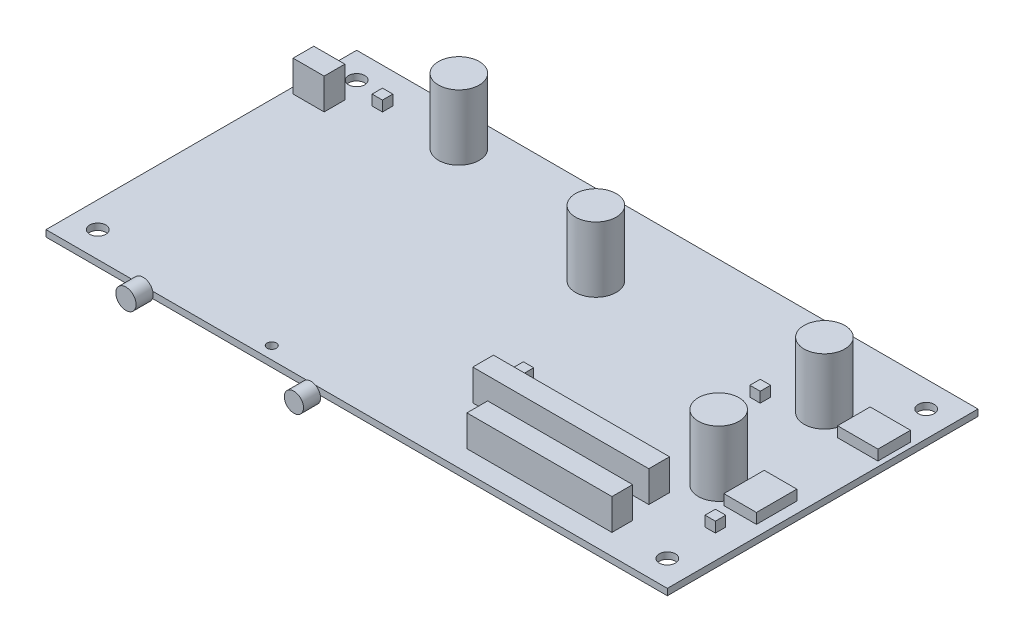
ISO-10303-21;
HEADER;
FILE_DESCRIPTION(('STEP AP214'),'2;1');
FILE_NAME('part.step','',(''),(''),'','','');
FILE_SCHEMA(('AUTOMOTIVE_DESIGN { 1 0 10303 214 1 1 1 1 }'));
ENDSEC;
DATA;
#1=APPLICATION_CONTEXT('core data for automotive mechanical design processes');
#2=APPLICATION_PROTOCOL_DEFINITION('international standard','automotive_design',2000,#1);
#3=PRODUCT_CONTEXT('',#1,'mechanical');
#4=PRODUCT('Part','Part','',(#3));
#5=PRODUCT_RELATED_PRODUCT_CATEGORY('part','',(#4));
#6=PRODUCT_DEFINITION_FORMATION('','',#4);
#7=PRODUCT_DEFINITION_CONTEXT('part definition',#1,'design');
#8=PRODUCT_DEFINITION('design','',#6,#7);
#9=PRODUCT_DEFINITION_SHAPE('','',#8);
#10=(LENGTH_UNIT() NAMED_UNIT(*) SI_UNIT(.MILLI.,.METRE.));
#11=(NAMED_UNIT(*) PLANE_ANGLE_UNIT() SI_UNIT($,.RADIAN.));
#12=(NAMED_UNIT(*) SI_UNIT($,.STERADIAN.) SOLID_ANGLE_UNIT());
#13=UNCERTAINTY_MEASURE_WITH_UNIT(LENGTH_MEASURE(1.E-05),#10,'distance_accuracy_value','');
#14=(GEOMETRIC_REPRESENTATION_CONTEXT(3) GLOBAL_UNCERTAINTY_ASSIGNED_CONTEXT((#13)) GLOBAL_UNIT_ASSIGNED_CONTEXT((#10,
#11,#12)) REPRESENTATION_CONTEXT('',''));
#15=CARTESIAN_POINT('',(0.,0.,0.));
#16=DIRECTION('',(0.,0.,1.));
#17=DIRECTION('',(1.,0.,0.));
#18=AXIS2_PLACEMENT_3D('',#15,#16,#17);
#19=CARTESIAN_POINT('',(66.2686,0.793750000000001,5.461));
#20=DIRECTION('',(0.,0.,-1.));
#21=DIRECTION('',(-1.,0.,0.));
#22=AXIS2_PLACEMENT_3D('',#19,#20,#21);
#23=CYLINDRICAL_SURFACE('',#22,2.3495);
#24=CARTESIAN_POINT('',(66.2686,0.793750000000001,5.461));
#25=DIRECTION('',(0.,0.,1.));
#26=DIRECTION('',(1.,0.,0.));
#27=AXIS2_PLACEMENT_3D('',#24,#25,#26);
#28=CIRCLE('',#27,2.3495);
#29=CARTESIAN_POINT('',(68.6181,0.793750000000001,5.461));
#30=VERTEX_POINT('',#29);
#31=EDGE_CURVE('E11',#30,#30,#28,.T.);
#32=ORIENTED_EDGE('',*,*,#31,.F.);
#33=EDGE_LOOP('',(#32));
#34=FACE_BOUND('',#33,.T.);
#35=CARTESIAN_POINT('',(66.2686,0.793750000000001,1.27));
#36=DIRECTION('',(0.,0.,1.));
#37=DIRECTION('',(1.,0.,0.));
#38=AXIS2_PLACEMENT_3D('',#35,#36,#37);
#39=CIRCLE('',#38,2.3495);
#40=CARTESIAN_POINT('',(68.6181,0.793750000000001,1.27));
#41=VERTEX_POINT('',#40);
#42=EDGE_CURVE('E42',#41,#41,#39,.T.);
#43=ORIENTED_EDGE('',*,*,#42,.T.);
#44=EDGE_LOOP('',(#43));
#45=FACE_BOUND('',#44,.T.);
#46=ADVANCED_FACE('F36',(#34,#45),#23,.T.);
#47=CARTESIAN_POINT('',(66.2686,0.793750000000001,5.461));
#48=DIRECTION('',(0.,0.,1.));
#49=DIRECTION('',(1.,0.,0.));
#50=AXIS2_PLACEMENT_3D('',#47,#48,#49);
#51=PLANE('',#50);
#52=ORIENTED_EDGE('',*,*,#31,.T.);
#53=EDGE_LOOP('',(#52));
#54=FACE_BOUND('',#53,.T.);
#55=ADVANCED_FACE('F51',(#54),#51,.T.);
#56=CARTESIAN_POINT('',(66.2686,0.793750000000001,1.27));
#57=DIRECTION('',(0.,0.,1.));
#58=DIRECTION('',(1.,0.,0.));
#59=AXIS2_PLACEMENT_3D('',#56,#57,#58);
#60=PLANE('',#59);
#61=ORIENTED_EDGE('',*,*,#42,.F.);
#62=EDGE_LOOP('',(#61));
#63=FACE_BOUND('',#62,.T.);
#64=ADVANCED_FACE('F49',(#63),#60,.F.);
#65=CLOSED_SHELL('',(#46,#55,#64));
#66=MANIFOLD_SOLID_BREP('B2',#65);
#67=CARTESIAN_POINT('',(24.6888,1.7907,5.08));
#68=DIRECTION('',(0.,0.,-1.));
#69=DIRECTION('',(-1.,0.,0.));
#70=AXIS2_PLACEMENT_3D('',#67,#68,#69);
#71=CYLINDRICAL_SURFACE('',#70,2.4892);
#72=CARTESIAN_POINT('',(24.6888,1.7907,5.08));
#73=DIRECTION('',(0.,0.,1.));
#74=DIRECTION('',(1.,0.,0.));
#75=AXIS2_PLACEMENT_3D('',#72,#73,#74);
#76=CIRCLE('',#75,2.4892);
#77=CARTESIAN_POINT('',(27.178,1.7907,5.08));
#78=VERTEX_POINT('',#77);
#79=EDGE_CURVE('E35',#78,#78,#76,.T.);
#80=ORIENTED_EDGE('',*,*,#79,.F.);
#81=EDGE_LOOP('',(#80));
#82=FACE_BOUND('',#81,.T.);
#83=CARTESIAN_POINT('',(24.6888,1.7907,0.889));
#84=DIRECTION('',(0.,0.,1.));
#85=DIRECTION('',(1.,0.,0.));
#86=AXIS2_PLACEMENT_3D('',#83,#84,#85);
#87=CIRCLE('',#86,2.4892);
#88=CARTESIAN_POINT('',(27.178,1.7907,0.889));
#89=VERTEX_POINT('',#88);
#90=EDGE_CURVE('E86',#89,#89,#87,.T.);
#91=ORIENTED_EDGE('',*,*,#90,.T.);
#92=EDGE_LOOP('',(#91));
#93=FACE_BOUND('',#92,.T.);
#94=ADVANCED_FACE('F80',(#82,#93),#71,.T.);
#95=CARTESIAN_POINT('',(24.6888,1.7907,5.08));
#96=DIRECTION('',(0.,0.,1.));
#97=DIRECTION('',(1.,0.,0.));
#98=AXIS2_PLACEMENT_3D('',#95,#96,#97);
#99=PLANE('',#98);
#100=ORIENTED_EDGE('',*,*,#79,.T.);
#101=EDGE_LOOP('',(#100));
#102=FACE_BOUND('',#101,.T.);
#103=ADVANCED_FACE('F95',(#102),#99,.T.);
#104=CARTESIAN_POINT('',(24.6888,1.7907,0.889));
#105=DIRECTION('',(0.,0.,1.));
#106=DIRECTION('',(1.,0.,0.));
#107=AXIS2_PLACEMENT_3D('',#104,#105,#106);
#108=PLANE('',#107);
#109=ORIENTED_EDGE('',*,*,#90,.F.);
#110=EDGE_LOOP('',(#109));
#111=FACE_BOUND('',#110,.T.);
#112=ADVANCED_FACE('F93',(#111),#108,.F.);
#113=CLOSED_SHELL('',(#94,#103,#112));
#114=MANIFOLD_SOLID_BREP('B6',#113);
#115=CARTESIAN_POINT('',(0.,1.5875,-76.2));
#116=DIRECTION('',(0.,-1.,0.));
#117=DIRECTION('',(0.,0.,-1.));
#118=AXIS2_PLACEMENT_3D('',#115,#116,#117);
#119=PLANE('',#118);
#120=DIRECTION('',(0.,0.,1.));
#121=VECTOR('',#120,1.);
#122=CARTESIAN_POINT('',(89.154,1.5875,-27.94));
#123=LINE('',#122,#121);
#124=CARTESIAN_POINT('',(89.154,1.5875,-27.94));
#125=VERTEX_POINT('',#124);
#126=CARTESIAN_POINT('',(89.154,1.5875,-25.4));
#127=VERTEX_POINT('',#126);
#128=EDGE_CURVE('E401',#125,#127,#123,.T.);
#129=ORIENTED_EDGE('',*,*,#128,.F.);
#130=DIRECTION('',(-1.,0.,0.));
#131=VECTOR('',#130,1.);
#132=CARTESIAN_POINT('',(89.154,1.5875,-27.94));
#133=LINE('',#132,#131);
#134=CARTESIAN_POINT('',(91.694,1.5875,-27.94));
#135=VERTEX_POINT('',#134);
#136=EDGE_CURVE('E410',#135,#125,#133,.T.);
#137=ORIENTED_EDGE('',*,*,#136,.F.);
#138=DIRECTION('',(0.,0.,-1.));
#139=VECTOR('',#138,1.);
#140=CARTESIAN_POINT('',(91.694,1.5875,-27.94));
#141=LINE('',#140,#139);
#142=CARTESIAN_POINT('',(91.694,1.5875,-25.4));
#143=VERTEX_POINT('',#142);
#144=EDGE_CURVE('E407',#143,#135,#141,.T.);
#145=ORIENTED_EDGE('',*,*,#144,.F.);
#146=DIRECTION('',(1.,0.,0.));
#147=VECTOR('',#146,1.);
#148=CARTESIAN_POINT('',(89.154,1.5875,-25.4));
#149=LINE('',#148,#147);
#150=EDGE_CURVE('E404',#127,#143,#149,.T.);
#151=ORIENTED_EDGE('',*,*,#150,.F.);
#152=EDGE_LOOP('',(#129,#137,#145,#151));
#153=FACE_BOUND('',#152,.T.);
#154=DIRECTION('',(0.,0.,1.));
#155=VECTOR('',#154,1.);
#156=CARTESIAN_POINT('',(144.018,1.5875,-20.1676));
#157=LINE('',#156,#155);
#158=CARTESIAN_POINT('',(144.018,1.5875,-20.1676));
#159=VERTEX_POINT('',#158);
#160=CARTESIAN_POINT('',(144.018,1.5875,-17.6276));
#161=VERTEX_POINT('',#160);
#162=EDGE_CURVE('E467',#159,#161,#157,.T.);
#163=ORIENTED_EDGE('',*,*,#162,.F.);
#164=DIRECTION('',(-1.,0.,0.));
#165=VECTOR('',#164,1.);
#166=CARTESIAN_POINT('',(144.018,1.5875,-20.1676));
#167=LINE('',#166,#165);
#168=CARTESIAN_POINT('',(146.558,1.5875,-20.1676));
#169=VERTEX_POINT('',#168);
#170=EDGE_CURVE('E476',#169,#159,#167,.T.);
#171=ORIENTED_EDGE('',*,*,#170,.F.);
#172=DIRECTION('',(0.,0.,-1.));
#173=VECTOR('',#172,1.);
#174=CARTESIAN_POINT('',(146.558,1.5875,-20.1676));
#175=LINE('',#174,#173);
#176=CARTESIAN_POINT('',(146.558,1.5875,-17.6276));
#177=VERTEX_POINT('',#176);
#178=EDGE_CURVE('E473',#177,#169,#175,.T.);
#179=ORIENTED_EDGE('',*,*,#178,.F.);
#180=DIRECTION('',(1.,0.,0.));
#181=VECTOR('',#180,1.);
#182=CARTESIAN_POINT('',(144.018,1.5875,-17.6276));
#183=LINE('',#182,#181);
#184=EDGE_CURVE('E470',#161,#177,#183,.T.);
#185=ORIENTED_EDGE('',*,*,#184,.F.);
#186=EDGE_LOOP('',(#163,#171,#179,#185));
#187=FACE_BOUND('',#186,.T.);
#188=DIRECTION('',(0.,0.,1.));
#189=VECTOR('',#188,1.);
#190=CARTESIAN_POINT('',(141.2748,1.5875,-60.8711));
#191=LINE('',#190,#189);
#192=CARTESIAN_POINT('',(141.2748,1.5875,-60.8711));
#193=VERTEX_POINT('',#192);
#194=CARTESIAN_POINT('',(141.2748,1.5875,-52.8701));
#195=VERTEX_POINT('',#194);
#196=EDGE_CURVE('E533',#193,#195,#191,.T.);
#197=ORIENTED_EDGE('',*,*,#196,.F.);
#198=DIRECTION('',(-1.,0.,0.));
#199=VECTOR('',#198,1.);
#200=CARTESIAN_POINT('',(141.2748,1.5875,-60.8711));
#201=LINE('',#200,#199);
#202=CARTESIAN_POINT('',(151.1808,1.5875,-60.8711));
#203=VERTEX_POINT('',#202);
#204=EDGE_CURVE('E542',#203,#193,#201,.T.);
#205=ORIENTED_EDGE('',*,*,#204,.F.);
#206=DIRECTION('',(0.,0.,-1.));
#207=VECTOR('',#206,1.);
#208=CARTESIAN_POINT('',(151.1808,1.5875,-60.8711));
#209=LINE('',#208,#207);
#210=CARTESIAN_POINT('',(151.1808,1.5875,-52.8701));
#211=VERTEX_POINT('',#210);
#212=EDGE_CURVE('E539',#211,#203,#209,.T.);
#213=ORIENTED_EDGE('',*,*,#212,.F.);
#214=DIRECTION('',(1.,0.,0.));
#215=VECTOR('',#214,1.);
#216=CARTESIAN_POINT('',(141.2748,1.5875,-52.8701));
#217=LINE('',#216,#215);
#218=EDGE_CURVE('E536',#195,#211,#217,.T.);
#219=ORIENTED_EDGE('',*,*,#218,.F.);
#220=EDGE_LOOP('',(#197,#205,#213,#219));
#221=FACE_BOUND('',#220,.T.);
#222=DIRECTION('',(0.,0.,1.));
#223=VECTOR('',#222,1.);
#224=CARTESIAN_POINT('',(89.154,1.5875,-20.5994));
#225=LINE('',#224,#223);
#226=CARTESIAN_POINT('',(89.154,1.5875,-20.5994));
#227=VERTEX_POINT('',#226);
#228=CARTESIAN_POINT('',(89.154,1.5875,-15.5194));
#229=VERTEX_POINT('',#228);
#230=EDGE_CURVE('E599',#227,#229,#225,.T.);
#231=ORIENTED_EDGE('',*,*,#230,.F.);
#232=DIRECTION('',(-1.,0.,0.));
#233=VECTOR('',#232,1.);
#234=CARTESIAN_POINT('',(89.154,1.5875,-20.5994));
#235=LINE('',#234,#233);
#236=CARTESIAN_POINT('',(132.334,1.5875,-20.5994));
#237=VERTEX_POINT('',#236);
#238=EDGE_CURVE('E608',#237,#227,#235,.T.);
#239=ORIENTED_EDGE('',*,*,#238,.F.);
#240=DIRECTION('',(0.,0.,-1.));
#241=VECTOR('',#240,1.);
#242=CARTESIAN_POINT('',(132.334,1.5875,-20.5994));
#243=LINE('',#242,#241);
#244=CARTESIAN_POINT('',(132.334,1.5875,-15.5194));
#245=VERTEX_POINT('',#244);
#246=EDGE_CURVE('E605',#245,#237,#243,.T.);
#247=ORIENTED_EDGE('',*,*,#246,.F.);
#248=DIRECTION('',(1.,0.,0.));
#249=VECTOR('',#248,1.);
#250=CARTESIAN_POINT('',(89.154,1.5875,-15.5194));
#251=LINE('',#250,#249);
#252=EDGE_CURVE('E602',#229,#245,#251,.T.);
#253=ORIENTED_EDGE('',*,*,#252,.F.);
#254=EDGE_LOOP('',(#231,#239,#247,#253));
#255=FACE_BOUND('',#254,.T.);
#256=CARTESIAN_POINT('',(33.4264,1.5875,-67.8434));
#257=DIRECTION('',(0.,-1.,0.));
#258=DIRECTION('',(0.,0.,-1.));
#259=AXIS2_PLACEMENT_3D('',#256,#257,#258);
#260=CIRCLE('',#259,5.00000000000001);
#261=CARTESIAN_POINT('',(33.4264,1.5875,-72.8434));
#262=VERTEX_POINT('',#261);
#263=EDGE_CURVE('E78',#262,#262,#260,.F.);
#264=ORIENTED_EDGE('',*,*,#263,.F.);
#265=EDGE_LOOP('',(#264));
#266=FACE_BOUND('',#265,.T.);
#267=CARTESIAN_POINT('',(136.7028,1.5875,-28.29814));
#268=DIRECTION('',(0.,-1.,0.));
#269=DIRECTION('',(0.,0.,-1.));
#270=AXIS2_PLACEMENT_3D('',#267,#268,#269);
#271=CIRCLE('',#270,5.00000000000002);
#272=CARTESIAN_POINT('',(136.7028,1.5875,-33.29814));
#273=VERTEX_POINT('',#272);
#274=EDGE_CURVE('E737',#273,#273,#271,.F.);
#275=ORIENTED_EDGE('',*,*,#274,.F.);
#276=EDGE_LOOP('',(#275));
#277=FACE_BOUND('',#276,.T.);
#278=CARTESIAN_POINT('',(146.05,1.5875,-6.35));
#279=DIRECTION('',(0.,1.,0.));
#280=DIRECTION('',(0.,0.,1.));
#281=AXIS2_PLACEMENT_3D('',#278,#279,#280);
#282=CIRCLE('',#281,1.9812);
#283=CARTESIAN_POINT('',(146.05,1.5875,-4.3688));
#284=VERTEX_POINT('',#283);
#285=EDGE_CURVE('E683',#284,#284,#282,.T.);
#286=ORIENTED_EDGE('',*,*,#285,.F.);
#287=EDGE_LOOP('',(#286));
#288=FACE_BOUND('',#287,.T.);
#289=CARTESIAN_POINT('',(146.05,1.5875,-69.85));
#290=DIRECTION('',(0.,1.,0.));
#291=DIRECTION('',(0.,0.,1.));
#292=AXIS2_PLACEMENT_3D('',#289,#290,#291);
#293=CIRCLE('',#292,1.9812);
#294=CARTESIAN_POINT('',(146.05,1.5875,-67.8688));
#295=VERTEX_POINT('',#294);
#296=EDGE_CURVE('E695',#295,#295,#293,.T.);
#297=ORIENTED_EDGE('',*,*,#296,.F.);
#298=EDGE_LOOP('',(#297));
#299=FACE_BOUND('',#298,.T.);
#300=DIRECTION('',(0.,0.,1.));
#301=VECTOR('',#300,1.);
#302=CARTESIAN_POINT('',(0.,1.5875,0.));
#303=LINE('',#302,#301);
#304=CARTESIAN_POINT('',(0.,1.5875,-76.2));
#305=VERTEX_POINT('',#304);
#306=CARTESIAN_POINT('',(0.,1.5875,0.));
#307=VERTEX_POINT('',#306);
#308=EDGE_CURVE('E713',#305,#307,#303,.T.);
#309=ORIENTED_EDGE('',*,*,#308,.T.);
#310=DIRECTION('',(1.,0.,0.));
#311=VECTOR('',#310,1.);
#312=CARTESIAN_POINT('',(0.,1.5875,0.));
#313=LINE('',#312,#311);
#314=CARTESIAN_POINT('',(152.4,1.5875,0.));
#315=VERTEX_POINT('',#314);
#316=EDGE_CURVE('E716',#307,#315,#313,.T.);
#317=ORIENTED_EDGE('',*,*,#316,.T.);
#318=DIRECTION('',(0.,0.,-1.));
#319=VECTOR('',#318,1.);
#320=CARTESIAN_POINT('',(152.4,1.5875,0.));
#321=LINE('',#320,#319);
#322=CARTESIAN_POINT('',(152.4,1.5875,-76.2));
#323=VERTEX_POINT('',#322);
#324=EDGE_CURVE('E718',#315,#323,#321,.T.);
#325=ORIENTED_EDGE('',*,*,#324,.T.);
#326=DIRECTION('',(-1.,0.,0.));
#327=VECTOR('',#326,1.);
#328=CARTESIAN_POINT('',(0.,1.5875,-76.2));
#329=LINE('',#328,#327);
#330=EDGE_CURVE('E720',#323,#305,#329,.T.);
#331=ORIENTED_EDGE('',*,*,#330,.T.);
#332=EDGE_LOOP('',(#309,#317,#325,#331));
#333=FACE_BOUND('',#332,.T.);
#334=CARTESIAN_POINT('',(6.35,1.5875,-69.85));
#335=DIRECTION('',(0.,1.,0.));
#336=DIRECTION('',(0.,0.,1.));
#337=AXIS2_PLACEMENT_3D('',#334,#335,#336);
#338=CIRCLE('',#337,1.9812);
#339=CARTESIAN_POINT('',(6.35,1.5875,-67.8688));
#340=VERTEX_POINT('',#339);
#341=EDGE_CURVE('E701',#340,#340,#338,.T.);
#342=ORIENTED_EDGE('',*,*,#341,.F.);
#343=EDGE_LOOP('',(#342));
#344=FACE_BOUND('',#343,.T.);
#345=CARTESIAN_POINT('',(6.35,1.5875,-6.35));
#346=DIRECTION('',(0.,1.,0.));
#347=DIRECTION('',(0.,0.,1.));
#348=AXIS2_PLACEMENT_3D('',#345,#346,#347);
#349=CIRCLE('',#348,1.9812);
#350=CARTESIAN_POINT('',(6.35,1.5875,-4.3688));
#351=VERTEX_POINT('',#350);
#352=EDGE_CURVE('E689',#351,#351,#349,.T.);
#353=ORIENTED_EDGE('',*,*,#352,.F.);
#354=EDGE_LOOP('',(#353));
#355=FACE_BOUND('',#354,.T.);
#356=CARTESIAN_POINT('',(78.2828,1.5875,-56.5912));
#357=DIRECTION('',(0.,-1.,0.));
#358=DIRECTION('',(0.,0.,-1.));
#359=AXIS2_PLACEMENT_3D('',#356,#357,#358);
#360=CIRCLE('',#359,5.00000000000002);
#361=CARTESIAN_POINT('',(78.2828,1.5875,-61.5912));
#362=VERTEX_POINT('',#361);
#363=EDGE_CURVE('E734',#362,#362,#360,.F.);
#364=ORIENTED_EDGE('',*,*,#363,.F.);
#365=EDGE_LOOP('',(#364));
#366=FACE_BOUND('',#365,.T.);
#367=CARTESIAN_POINT('',(134.3152,1.5875,-56.6166));
#368=DIRECTION('',(0.,-1.,0.));
#369=DIRECTION('',(0.,0.,-1.));
#370=AXIS2_PLACEMENT_3D('',#367,#368,#369);
#371=CIRCLE('',#370,5.00000000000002);
#372=CARTESIAN_POINT('',(134.3152,1.5875,-61.6166));
#373=VERTEX_POINT('',#372);
#374=EDGE_CURVE('E124',#373,#373,#371,.F.);
#375=ORIENTED_EDGE('',*,*,#374,.F.);
#376=EDGE_LOOP('',(#375));
#377=FACE_BOUND('',#376,.T.);
#378=CARTESIAN_POINT('',(52.324,1.5875,-3.048));
#379=DIRECTION('',(0.,1.,0.));
#380=DIRECTION('',(0.,0.,1.));
#381=AXIS2_PLACEMENT_3D('',#378,#379,#380);
#382=CIRCLE('',#381,1.1303);
#383=CARTESIAN_POINT('',(52.324,1.5875,-1.91769999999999));
#384=VERTEX_POINT('',#383);
#385=EDGE_CURVE('E665',#384,#384,#382,.T.);
#386=ORIENTED_EDGE('',*,*,#385,.F.);
#387=EDGE_LOOP('',(#386));
#388=FACE_BOUND('',#387,.T.);
#389=DIRECTION('',(0.,0.,1.));
#390=VECTOR('',#389,1.);
#391=CARTESIAN_POINT('',(98.171,1.5875,-10.16));
#392=LINE('',#391,#390);
#393=CARTESIAN_POINT('',(98.171,1.5875,-10.16));
#394=VERTEX_POINT('',#393);
#395=CARTESIAN_POINT('',(98.171,1.5875,-5.08000000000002));
#396=VERTEX_POINT('',#395);
#397=EDGE_CURVE('E632',#394,#396,#392,.T.);
#398=ORIENTED_EDGE('',*,*,#397,.F.);
#399=DIRECTION('',(-1.,0.,0.));
#400=VECTOR('',#399,1.);
#401=CARTESIAN_POINT('',(98.171,1.5875,-10.16));
#402=LINE('',#401,#400);
#403=CARTESIAN_POINT('',(133.731,1.5875,-10.16));
#404=VERTEX_POINT('',#403);
#405=EDGE_CURVE('E641',#404,#394,#402,.T.);
#406=ORIENTED_EDGE('',*,*,#405,.F.);
#407=DIRECTION('',(0.,0.,-1.));
#408=VECTOR('',#407,1.);
#409=CARTESIAN_POINT('',(133.731,1.5875,-10.16));
#410=LINE('',#409,#408);
#411=CARTESIAN_POINT('',(133.731,1.5875,-5.08000000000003));
#412=VERTEX_POINT('',#411);
#413=EDGE_CURVE('E638',#412,#404,#410,.T.);
#414=ORIENTED_EDGE('',*,*,#413,.F.);
#415=DIRECTION('',(1.,0.,0.));
#416=VECTOR('',#415,1.);
#417=CARTESIAN_POINT('',(98.171,1.5875,-5.08000000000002));
#418=LINE('',#417,#416);
#419=EDGE_CURVE('E635',#396,#412,#418,.T.);
#420=ORIENTED_EDGE('',*,*,#419,.F.);
#421=EDGE_LOOP('',(#398,#406,#414,#420));
#422=FACE_BOUND('',#421,.T.);
#423=DIRECTION('',(0.,0.,1.));
#424=VECTOR('',#423,1.);
#425=CARTESIAN_POINT('',(1.4986,1.5875,-64.1858));
#426=LINE('',#425,#424);
#427=CARTESIAN_POINT('',(1.4986,1.5875,-64.1858));
#428=VERTEX_POINT('',#427);
#429=CARTESIAN_POINT('',(1.4986,1.5875,-59.1058));
#430=VERTEX_POINT('',#429);
#431=EDGE_CURVE('E566',#428,#430,#426,.T.);
#432=ORIENTED_EDGE('',*,*,#431,.F.);
#433=DIRECTION('',(-1.,0.,0.));
#434=VECTOR('',#433,1.);
#435=CARTESIAN_POINT('',(1.4986,1.5875,-64.1858));
#436=LINE('',#435,#434);
#437=CARTESIAN_POINT('',(9.1186,1.5875,-64.1858));
#438=VERTEX_POINT('',#437);
#439=EDGE_CURVE('E575',#438,#428,#436,.T.);
#440=ORIENTED_EDGE('',*,*,#439,.F.);
#441=DIRECTION('',(0.,0.,-1.));
#442=VECTOR('',#441,1.);
#443=CARTESIAN_POINT('',(9.1186,1.5875,-64.1858));
#444=LINE('',#443,#442);
#445=CARTESIAN_POINT('',(9.1186,1.5875,-59.1058));
#446=VERTEX_POINT('',#445);
#447=EDGE_CURVE('E572',#446,#438,#444,.T.);
#448=ORIENTED_EDGE('',*,*,#447,.F.);
#449=DIRECTION('',(1.,0.,0.));
#450=VECTOR('',#449,1.);
#451=CARTESIAN_POINT('',(1.4986,1.5875,-59.1058));
#452=LINE('',#451,#450);
#453=EDGE_CURVE('E569',#430,#446,#452,.T.);
#454=ORIENTED_EDGE('',*,*,#453,.F.);
#455=EDGE_LOOP('',(#432,#440,#448,#454));
#456=FACE_BOUND('',#455,.T.);
#457=DIRECTION('',(0.,0.,1.));
#458=VECTOR('',#457,1.);
#459=CARTESIAN_POINT('',(141.7447,1.5875,-34.417));
#460=LINE('',#459,#458);
#461=CARTESIAN_POINT('',(141.7447,1.5875,-34.417));
#462=VERTEX_POINT('',#461);
#463=CARTESIAN_POINT('',(141.7447,1.5875,-24.511));
#464=VERTEX_POINT('',#463);
#465=EDGE_CURVE('E500',#462,#464,#460,.T.);
#466=ORIENTED_EDGE('',*,*,#465,.F.);
#467=DIRECTION('',(-1.,0.,0.));
#468=VECTOR('',#467,1.);
#469=CARTESIAN_POINT('',(141.7447,1.5875,-34.417));
#470=LINE('',#469,#468);
#471=CARTESIAN_POINT('',(149.7457,1.5875,-34.417));
#472=VERTEX_POINT('',#471);
#473=EDGE_CURVE('E509',#472,#462,#470,.T.);
#474=ORIENTED_EDGE('',*,*,#473,.F.);
#475=DIRECTION('',(0.,0.,-1.));
#476=VECTOR('',#475,1.);
#477=CARTESIAN_POINT('',(149.7457,1.5875,-34.417));
#478=LINE('',#477,#476);
#479=CARTESIAN_POINT('',(149.7457,1.5875,-24.511));
#480=VERTEX_POINT('',#479);
#481=EDGE_CURVE('E506',#480,#472,#478,.T.);
#482=ORIENTED_EDGE('',*,*,#481,.F.);
#483=DIRECTION('',(1.,0.,0.));
#484=VECTOR('',#483,1.);
#485=CARTESIAN_POINT('',(141.7447,1.5875,-24.511));
#486=LINE('',#485,#484);
#487=EDGE_CURVE('E503',#464,#480,#486,.T.);
#488=ORIENTED_EDGE('',*,*,#487,.F.);
#489=EDGE_LOOP('',(#466,#474,#482,#488));
#490=FACE_BOUND('',#489,.T.);
#491=DIRECTION('',(0.,0.,1.));
#492=VECTOR('',#491,1.);
#493=CARTESIAN_POINT('',(121.92,1.5875,-53.2638));
#494=LINE('',#493,#492);
#495=CARTESIAN_POINT('',(121.92,1.5875,-53.2638));
#496=VERTEX_POINT('',#495);
#497=CARTESIAN_POINT('',(121.92,1.5875,-50.7238));
#498=VERTEX_POINT('',#497);
#499=EDGE_CURVE('E434',#496,#498,#494,.T.);
#500=ORIENTED_EDGE('',*,*,#499,.F.);
#501=DIRECTION('',(-1.,0.,0.));
#502=VECTOR('',#501,1.);
#503=CARTESIAN_POINT('',(121.92,1.5875,-53.2638));
#504=LINE('',#503,#502);
#505=CARTESIAN_POINT('',(124.46,1.5875,-53.2638));
#506=VERTEX_POINT('',#505);
#507=EDGE_CURVE('E443',#506,#496,#504,.T.);
#508=ORIENTED_EDGE('',*,*,#507,.F.);
#509=DIRECTION('',(0.,0.,-1.));
#510=VECTOR('',#509,1.);
#511=CARTESIAN_POINT('',(124.46,1.5875,-53.2638));
#512=LINE('',#511,#510);
#513=CARTESIAN_POINT('',(124.46,1.5875,-50.7238));
#514=VERTEX_POINT('',#513);
#515=EDGE_CURVE('E440',#514,#506,#512,.T.);
#516=ORIENTED_EDGE('',*,*,#515,.F.);
#517=DIRECTION('',(1.,0.,0.));
#518=VECTOR('',#517,1.);
#519=CARTESIAN_POINT('',(121.92,1.5875,-50.7238));
#520=LINE('',#519,#518);
#521=EDGE_CURVE('E437',#498,#514,#520,.T.);
#522=ORIENTED_EDGE('',*,*,#521,.F.);
#523=EDGE_LOOP('',(#500,#508,#516,#522));
#524=FACE_BOUND('',#523,.T.);
#525=DIRECTION('',(0.,0.,1.));
#526=VECTOR('',#525,1.);
#527=CARTESIAN_POINT('',(13.7414,1.5875,-68.7832));
#528=LINE('',#527,#526);
#529=CARTESIAN_POINT('',(13.7414,1.5875,-68.7832));
#530=VERTEX_POINT('',#529);
#531=CARTESIAN_POINT('',(13.7414,1.5875,-66.2432));
#532=VERTEX_POINT('',#531);
#533=EDGE_CURVE('E369',#530,#532,#528,.T.);
#534=ORIENTED_EDGE('',*,*,#533,.F.);
#535=DIRECTION('',(-1.,0.,0.));
#536=VECTOR('',#535,1.);
#537=CARTESIAN_POINT('',(13.7414,1.5875,-68.7832));
#538=LINE('',#537,#536);
#539=CARTESIAN_POINT('',(16.2814,1.5875,-68.7832));
#540=VERTEX_POINT('',#539);
#541=EDGE_CURVE('E371',#540,#530,#538,.T.);
#542=ORIENTED_EDGE('',*,*,#541,.F.);
#543=DIRECTION('',(0.,0.,-1.));
#544=VECTOR('',#543,1.);
#545=CARTESIAN_POINT('',(16.2814,1.5875,-68.7832));
#546=LINE('',#545,#544);
#547=CARTESIAN_POINT('',(16.2814,1.5875,-66.2432));
#548=VERTEX_POINT('',#547);
#549=EDGE_CURVE('E136',#548,#540,#546,.T.);
#550=ORIENTED_EDGE('',*,*,#549,.F.);
#551=DIRECTION('',(1.,0.,0.));
#552=VECTOR('',#551,1.);
#553=CARTESIAN_POINT('',(13.7414,1.5875,-66.2432));
#554=LINE('',#553,#552);
#555=EDGE_CURVE('E131',#532,#548,#554,.T.);
#556=ORIENTED_EDGE('',*,*,#555,.F.);
#557=EDGE_LOOP('',(#534,#542,#550,#556));
#558=FACE_BOUND('',#557,.T.);
#559=ADVANCED_FACE('F115',(#153,#187,#221,#255,#266,#277,#288,#299,#333,#344,#355,#366,#377,
#388,#422,#456,#490,#524,#558),#119,.F.);
#560=CARTESIAN_POINT('',(0.,0.,-76.2));
#561=DIRECTION('',(0.,-1.,0.));
#562=DIRECTION('',(0.,0.,-1.));
#563=AXIS2_PLACEMENT_3D('',#560,#561,#562);
#564=PLANE('',#563);
#565=CARTESIAN_POINT('',(52.324,0.,-3.048));
#566=DIRECTION('',(0.,-1.,0.));
#567=DIRECTION('',(0.,0.,-1.));
#568=AXIS2_PLACEMENT_3D('',#565,#566,#567);
#569=CIRCLE('',#568,1.1303);
#570=CARTESIAN_POINT('',(52.324,0.,-4.1783));
#571=VERTEX_POINT('',#570);
#572=EDGE_CURVE('E119',#571,#571,#569,.T.);
#573=ORIENTED_EDGE('',*,*,#572,.F.);
#574=EDGE_LOOP('',(#573));
#575=FACE_BOUND('',#574,.T.);
#576=CARTESIAN_POINT('',(6.35,0.,-6.35));
#577=DIRECTION('',(0.,1.,0.));
#578=DIRECTION('',(0.,0.,1.));
#579=AXIS2_PLACEMENT_3D('',#576,#577,#578);
#580=CIRCLE('',#579,1.9812);
#581=CARTESIAN_POINT('',(6.35,0.,-4.3688));
#582=VERTEX_POINT('',#581);
#583=EDGE_CURVE('E686',#582,#582,#580,.T.);
#584=ORIENTED_EDGE('',*,*,#583,.T.);
#585=EDGE_LOOP('',(#584));
#586=FACE_BOUND('',#585,.T.);
#587=CARTESIAN_POINT('',(6.35,0.,-69.85));
#588=DIRECTION('',(0.,1.,0.));
#589=DIRECTION('',(0.,0.,1.));
#590=AXIS2_PLACEMENT_3D('',#587,#588,#589);
#591=CIRCLE('',#590,1.9812);
#592=CARTESIAN_POINT('',(6.35,0.,-67.8688));
#593=VERTEX_POINT('',#592);
#594=EDGE_CURVE('E698',#593,#593,#591,.T.);
#595=ORIENTED_EDGE('',*,*,#594,.T.);
#596=EDGE_LOOP('',(#595));
#597=FACE_BOUND('',#596,.T.);
#598=DIRECTION('',(0.,0.,1.));
#599=VECTOR('',#598,1.);
#600=CARTESIAN_POINT('',(0.,0.,0.));
#601=LINE('',#600,#599);
#602=CARTESIAN_POINT('',(0.,0.,-76.2));
#603=VERTEX_POINT('',#602);
#604=CARTESIAN_POINT('',(0.,0.,0.));
#605=VERTEX_POINT('',#604);
#606=EDGE_CURVE('E704',#603,#605,#601,.T.);
#607=ORIENTED_EDGE('',*,*,#606,.F.);
#608=DIRECTION('',(-1.,0.,0.));
#609=VECTOR('',#608,1.);
#610=CARTESIAN_POINT('',(0.,0.,-76.2));
#611=LINE('',#610,#609);
#612=CARTESIAN_POINT('',(152.4,0.,-76.2));
#613=VERTEX_POINT('',#612);
#614=EDGE_CURVE('E711',#613,#603,#611,.T.);
#615=ORIENTED_EDGE('',*,*,#614,.F.);
#616=DIRECTION('',(0.,0.,-1.));
#617=VECTOR('',#616,1.);
#618=CARTESIAN_POINT('',(152.4,0.,0.));
#619=LINE('',#618,#617);
#620=CARTESIAN_POINT('',(152.4,0.,0.));
#621=VERTEX_POINT('',#620);
#622=EDGE_CURVE('E709',#621,#613,#619,.T.);
#623=ORIENTED_EDGE('',*,*,#622,.F.);
#624=DIRECTION('',(1.,0.,0.));
#625=VECTOR('',#624,1.);
#626=CARTESIAN_POINT('',(0.,0.,0.));
#627=LINE('',#626,#625);
#628=EDGE_CURVE('E707',#605,#621,#627,.T.);
#629=ORIENTED_EDGE('',*,*,#628,.F.);
#630=EDGE_LOOP('',(#607,#615,#623,#629));
#631=FACE_BOUND('',#630,.T.);
#632=CARTESIAN_POINT('',(146.05,0.,-69.85));
#633=DIRECTION('',(0.,1.,0.));
#634=DIRECTION('',(0.,0.,1.));
#635=AXIS2_PLACEMENT_3D('',#632,#633,#634);
#636=CIRCLE('',#635,1.9812);
#637=CARTESIAN_POINT('',(146.05,0.,-67.8688));
#638=VERTEX_POINT('',#637);
#639=EDGE_CURVE('E692',#638,#638,#636,.T.);
#640=ORIENTED_EDGE('',*,*,#639,.T.);
#641=EDGE_LOOP('',(#640));
#642=FACE_BOUND('',#641,.T.);
#643=CARTESIAN_POINT('',(146.05,0.,-6.35));
#644=DIRECTION('',(0.,1.,0.));
#645=DIRECTION('',(0.,0.,1.));
#646=AXIS2_PLACEMENT_3D('',#643,#644,#645);
#647=CIRCLE('',#646,1.9812);
#648=CARTESIAN_POINT('',(146.05,0.,-4.3688));
#649=VERTEX_POINT('',#648);
#650=EDGE_CURVE('E680',#649,#649,#647,.T.);
#651=ORIENTED_EDGE('',*,*,#650,.T.);
#652=EDGE_LOOP('',(#651));
#653=FACE_BOUND('',#652,.T.);
#654=ADVANCED_FACE('F747',(#575,#586,#597,#631,#642,#653),#564,.T.);
#655=CARTESIAN_POINT('',(0.,1.5875,0.));
#656=DIRECTION('',(1.,0.,0.));
#657=DIRECTION('',(0.,0.,-1.));
#658=AXIS2_PLACEMENT_3D('',#655,#656,#657);
#659=PLANE('',#658);
#660=ORIENTED_EDGE('',*,*,#606,.T.);
#661=DIRECTION('',(0.,-1.,0.));
#662=VECTOR('',#661,1.);
#663=CARTESIAN_POINT('',(0.,1.5875,0.));
#664=LINE('',#663,#662);
#665=EDGE_CURVE('E731',#307,#605,#664,.T.);
#666=ORIENTED_EDGE('',*,*,#665,.F.);
#667=ORIENTED_EDGE('',*,*,#308,.F.);
#668=DIRECTION('',(0.,-1.,0.));
#669=VECTOR('',#668,1.);
#670=CARTESIAN_POINT('',(0.,1.5875,-76.2));
#671=LINE('',#670,#669);
#672=EDGE_CURVE('E722',#305,#603,#671,.T.);
#673=ORIENTED_EDGE('',*,*,#672,.T.);
#674=EDGE_LOOP('',(#660,#666,#667,#673));
#675=FACE_BOUND('',#674,.T.);
#676=ADVANCED_FACE('F117',(#675),#659,.F.);
#677=CARTESIAN_POINT('',(0.,1.5875,0.));
#678=DIRECTION('',(0.,0.,-1.));
#679=DIRECTION('',(-1.,0.,0.));
#680=AXIS2_PLACEMENT_3D('',#677,#678,#679);
#681=PLANE('',#680);
#682=ORIENTED_EDGE('',*,*,#628,.T.);
#683=DIRECTION('',(0.,-1.,0.));
#684=VECTOR('',#683,1.);
#685=CARTESIAN_POINT('',(152.4,1.5875,0.));
#686=LINE('',#685,#684);
#687=EDGE_CURVE('E728',#315,#621,#686,.T.);
#688=ORIENTED_EDGE('',*,*,#687,.F.);
#689=ORIENTED_EDGE('',*,*,#316,.F.);
#690=ORIENTED_EDGE('',*,*,#665,.T.);
#691=EDGE_LOOP('',(#682,#688,#689,#690));
#692=FACE_BOUND('',#691,.T.);
#693=ADVANCED_FACE('F962',(#692),#681,.F.);
#694=CARTESIAN_POINT('',(152.4,1.5875,0.));
#695=DIRECTION('',(-1.,0.,0.));
#696=DIRECTION('',(0.,0.,1.));
#697=AXIS2_PLACEMENT_3D('',#694,#695,#696);
#698=PLANE('',#697);
#699=ORIENTED_EDGE('',*,*,#622,.T.);
#700=DIRECTION('',(0.,-1.,0.));
#701=VECTOR('',#700,1.);
#702=CARTESIAN_POINT('',(152.4,1.5875,-76.2));
#703=LINE('',#702,#701);
#704=EDGE_CURVE('E725',#323,#613,#703,.T.);
#705=ORIENTED_EDGE('',*,*,#704,.F.);
#706=ORIENTED_EDGE('',*,*,#324,.F.);
#707=ORIENTED_EDGE('',*,*,#687,.T.);
#708=EDGE_LOOP('',(#699,#705,#706,#707));
#709=FACE_BOUND('',#708,.T.);
#710=ADVANCED_FACE('F959',(#709),#698,.F.);
#711=CARTESIAN_POINT('',(0.,1.5875,-76.2));
#712=DIRECTION('',(0.,0.,1.));
#713=DIRECTION('',(1.,0.,0.));
#714=AXIS2_PLACEMENT_3D('',#711,#712,#713);
#715=PLANE('',#714);
#716=ORIENTED_EDGE('',*,*,#614,.T.);
#717=ORIENTED_EDGE('',*,*,#672,.F.);
#718=ORIENTED_EDGE('',*,*,#330,.F.);
#719=ORIENTED_EDGE('',*,*,#704,.T.);
#720=EDGE_LOOP('',(#716,#717,#718,#719));
#721=FACE_BOUND('',#720,.T.);
#722=ADVANCED_FACE('F952',(#721),#715,.F.);
#723=CARTESIAN_POINT('',(6.35,1.5875,-69.85));
#724=DIRECTION('',(0.,-1.,0.));
#725=DIRECTION('',(0.,0.,-1.));
#726=AXIS2_PLACEMENT_3D('',#723,#724,#725);
#727=CYLINDRICAL_SURFACE('',#726,1.9812);
#728=ORIENTED_EDGE('',*,*,#341,.T.);
#729=EDGE_LOOP('',(#728));
#730=FACE_BOUND('',#729,.T.);
#731=ORIENTED_EDGE('',*,*,#594,.F.);
#732=EDGE_LOOP('',(#731));
#733=FACE_BOUND('',#732,.T.);
#734=ADVANCED_FACE('F948',(#730,#733),#727,.F.);
#735=CARTESIAN_POINT('',(146.05,1.5875,-69.85));
#736=DIRECTION('',(0.,-1.,0.));
#737=DIRECTION('',(0.,0.,-1.));
#738=AXIS2_PLACEMENT_3D('',#735,#736,#737);
#739=CYLINDRICAL_SURFACE('',#738,1.9812);
#740=ORIENTED_EDGE('',*,*,#296,.T.);
#741=EDGE_LOOP('',(#740));
#742=FACE_BOUND('',#741,.T.);
#743=ORIENTED_EDGE('',*,*,#639,.F.);
#744=EDGE_LOOP('',(#743));
#745=FACE_BOUND('',#744,.T.);
#746=ADVANCED_FACE('F944',(#742,#745),#739,.F.);
#747=CARTESIAN_POINT('',(6.35,1.5875,-6.35));
#748=DIRECTION('',(0.,-1.,0.));
#749=DIRECTION('',(0.,0.,-1.));
#750=AXIS2_PLACEMENT_3D('',#747,#748,#749);
#751=CYLINDRICAL_SURFACE('',#750,1.9812);
#752=ORIENTED_EDGE('',*,*,#352,.T.);
#753=EDGE_LOOP('',(#752));
#754=FACE_BOUND('',#753,.T.);
#755=ORIENTED_EDGE('',*,*,#583,.F.);
#756=EDGE_LOOP('',(#755));
#757=FACE_BOUND('',#756,.T.);
#758=ADVANCED_FACE('F940',(#754,#757),#751,.F.);
#759=CARTESIAN_POINT('',(146.05,1.5875,-6.35));
#760=DIRECTION('',(0.,-1.,0.));
#761=DIRECTION('',(0.,0.,-1.));
#762=AXIS2_PLACEMENT_3D('',#759,#760,#761);
#763=CYLINDRICAL_SURFACE('',#762,1.9812);
#764=ORIENTED_EDGE('',*,*,#285,.T.);
#765=EDGE_LOOP('',(#764));
#766=FACE_BOUND('',#765,.T.);
#767=ORIENTED_EDGE('',*,*,#650,.F.);
#768=EDGE_LOOP('',(#767));
#769=FACE_BOUND('',#768,.T.);
#770=ADVANCED_FACE('F936',(#766,#769),#763,.F.);
#771=CARTESIAN_POINT('',(78.2828,17.5875,-56.5912));
#772=DIRECTION('',(0.,-1.,0.));
#773=DIRECTION('',(0.,0.,-1.));
#774=AXIS2_PLACEMENT_3D('',#771,#772,#773);
#775=CYLINDRICAL_SURFACE('',#774,5.00000000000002);
#776=CARTESIAN_POINT('',(78.2828,17.5875,-56.5912));
#777=DIRECTION('',(0.,1.,0.));
#778=DIRECTION('',(0.,0.,1.));
#779=AXIS2_PLACEMENT_3D('',#776,#777,#778);
#780=CIRCLE('',#779,5.00000000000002);
#781=CARTESIAN_POINT('',(78.2828,17.5875,-51.5912));
#782=VERTEX_POINT('',#781);
#783=EDGE_CURVE('E677',#782,#782,#780,.T.);
#784=ORIENTED_EDGE('',*,*,#783,.F.);
#785=EDGE_LOOP('',(#784));
#786=FACE_BOUND('',#785,.T.);
#787=ORIENTED_EDGE('',*,*,#363,.T.);
#788=EDGE_LOOP('',(#787));
#789=FACE_BOUND('',#788,.T.);
#790=ADVANCED_FACE('F932',(#786,#789),#775,.T.);
#791=CARTESIAN_POINT('',(78.2828,17.5875,-56.5912));
#792=DIRECTION('',(0.,1.,0.));
#793=DIRECTION('',(0.,0.,1.));
#794=AXIS2_PLACEMENT_3D('',#791,#792,#793);
#795=PLANE('',#794);
#796=ORIENTED_EDGE('',*,*,#783,.T.);
#797=EDGE_LOOP('',(#796));
#798=FACE_BOUND('',#797,.T.);
#799=ADVANCED_FACE('F928',(#798),#795,.T.);
#800=CARTESIAN_POINT('',(136.7028,17.5875,-28.29814));
#801=DIRECTION('',(0.,-1.,0.));
#802=DIRECTION('',(0.,0.,-1.));
#803=AXIS2_PLACEMENT_3D('',#800,#801,#802);
#804=CYLINDRICAL_SURFACE('',#803,5.00000000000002);
#805=CARTESIAN_POINT('',(136.7028,17.5875,-28.29814));
#806=DIRECTION('',(0.,1.,0.));
#807=DIRECTION('',(0.,0.,1.));
#808=AXIS2_PLACEMENT_3D('',#805,#806,#807);
#809=CIRCLE('',#808,5.00000000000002);
#810=CARTESIAN_POINT('',(136.7028,17.5875,-23.29814));
#811=VERTEX_POINT('',#810);
#812=EDGE_CURVE('E674',#811,#811,#809,.T.);
#813=ORIENTED_EDGE('',*,*,#812,.F.);
#814=EDGE_LOOP('',(#813));
#815=FACE_BOUND('',#814,.T.);
#816=ORIENTED_EDGE('',*,*,#274,.T.);
#817=EDGE_LOOP('',(#816));
#818=FACE_BOUND('',#817,.T.);
#819=ADVANCED_FACE('F924',(#815,#818),#804,.T.);
#820=CARTESIAN_POINT('',(136.7028,17.5875,-28.29814));
#821=DIRECTION('',(0.,1.,0.));
#822=DIRECTION('',(0.,0.,1.));
#823=AXIS2_PLACEMENT_3D('',#820,#821,#822);
#824=PLANE('',#823);
#825=ORIENTED_EDGE('',*,*,#812,.T.);
#826=EDGE_LOOP('',(#825));
#827=FACE_BOUND('',#826,.T.);
#828=ADVANCED_FACE('F920',(#827),#824,.T.);
#829=CARTESIAN_POINT('',(134.3152,17.5875,-56.6166));
#830=DIRECTION('',(0.,-1.,0.));
#831=DIRECTION('',(0.,0.,-1.));
#832=AXIS2_PLACEMENT_3D('',#829,#830,#831);
#833=CYLINDRICAL_SURFACE('',#832,5.00000000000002);
#834=CARTESIAN_POINT('',(134.3152,17.5875,-56.6166));
#835=DIRECTION('',(0.,1.,0.));
#836=DIRECTION('',(0.,0.,1.));
#837=AXIS2_PLACEMENT_3D('',#834,#835,#836);
#838=CIRCLE('',#837,5.00000000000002);
#839=CARTESIAN_POINT('',(134.3152,17.5875,-51.6166));
#840=VERTEX_POINT('',#839);
#841=EDGE_CURVE('E671',#840,#840,#838,.T.);
#842=ORIENTED_EDGE('',*,*,#841,.F.);
#843=EDGE_LOOP('',(#842));
#844=FACE_BOUND('',#843,.T.);
#845=ORIENTED_EDGE('',*,*,#374,.T.);
#846=EDGE_LOOP('',(#845));
#847=FACE_BOUND('',#846,.T.);
#848=ADVANCED_FACE('F743',(#844,#847),#833,.T.);
#849=CARTESIAN_POINT('',(134.3152,17.5875,-56.6166));
#850=DIRECTION('',(0.,1.,0.));
#851=DIRECTION('',(0.,0.,1.));
#852=AXIS2_PLACEMENT_3D('',#849,#850,#851);
#853=PLANE('',#852);
#854=ORIENTED_EDGE('',*,*,#841,.T.);
#855=EDGE_LOOP('',(#854));
#856=FACE_BOUND('',#855,.T.);
#857=ADVANCED_FACE('F913',(#856),#853,.T.);
#858=CARTESIAN_POINT('',(33.4264,17.5875,-67.8434));
#859=DIRECTION('',(0.,-1.,0.));
#860=DIRECTION('',(0.,0.,-1.));
#861=AXIS2_PLACEMENT_3D('',#858,#859,#860);
#862=CYLINDRICAL_SURFACE('',#861,5.00000000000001);
#863=CARTESIAN_POINT('',(33.4264,17.5875,-67.8434));
#864=DIRECTION('',(0.,1.,0.));
#865=DIRECTION('',(0.,0.,1.));
#866=AXIS2_PLACEMENT_3D('',#863,#864,#865);
#867=CIRCLE('',#866,5.00000000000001);
#868=CARTESIAN_POINT('',(33.4264,17.5875,-62.8434));
#869=VERTEX_POINT('',#868);
#870=EDGE_CURVE('E668',#869,#869,#867,.T.);
#871=ORIENTED_EDGE('',*,*,#870,.F.);
#872=EDGE_LOOP('',(#871));
#873=FACE_BOUND('',#872,.T.);
#874=ORIENTED_EDGE('',*,*,#263,.T.);
#875=EDGE_LOOP('',(#874));
#876=FACE_BOUND('',#875,.T.);
#877=ADVANCED_FACE('F909',(#873,#876),#862,.T.);
#878=CARTESIAN_POINT('',(33.4264,17.5875,-67.8434));
#879=DIRECTION('',(0.,1.,0.));
#880=DIRECTION('',(0.,0.,1.));
#881=AXIS2_PLACEMENT_3D('',#878,#879,#880);
#882=PLANE('',#881);
#883=ORIENTED_EDGE('',*,*,#870,.T.);
#884=EDGE_LOOP('',(#883));
#885=FACE_BOUND('',#884,.T.);
#886=ADVANCED_FACE('F905',(#885),#882,.T.);
#887=CARTESIAN_POINT('',(52.324,-14.4125,-3.048));
#888=DIRECTION('',(0.,1.,0.));
#889=DIRECTION('',(0.,0.,1.));
#890=AXIS2_PLACEMENT_3D('',#887,#888,#889);
#891=CYLINDRICAL_SURFACE('',#890,1.1303);
#892=ORIENTED_EDGE('',*,*,#572,.T.);
#893=EDGE_LOOP('',(#892));
#894=FACE_BOUND('',#893,.T.);
#895=ORIENTED_EDGE('',*,*,#385,.T.);
#896=EDGE_LOOP('',(#895));
#897=FACE_BOUND('',#896,.T.);
#898=ADVANCED_FACE('F901',(#894,#897),#891,.F.);
#899=CARTESIAN_POINT('',(98.171,9.2075,-10.16));
#900=DIRECTION('',(1.,0.,0.));
#901=DIRECTION('',(0.,0.,-1.));
#902=AXIS2_PLACEMENT_3D('',#899,#900,#901);
#903=PLANE('',#902);
#904=ORIENTED_EDGE('',*,*,#397,.T.);
#905=DIRECTION('',(0.,-1.,0.));
#906=VECTOR('',#905,1.);
#907=CARTESIAN_POINT('',(98.171,9.2075,-5.08000000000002));
#908=LINE('',#907,#906);
#909=CARTESIAN_POINT('',(98.171,9.2075,-5.08000000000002));
#910=VERTEX_POINT('',#909);
#911=EDGE_CURVE('E662',#910,#396,#908,.T.);
#912=ORIENTED_EDGE('',*,*,#911,.F.);
#913=DIRECTION('',(0.,0.,1.));
#914=VECTOR('',#913,1.);
#915=CARTESIAN_POINT('',(98.171,9.2075,-10.16));
#916=LINE('',#915,#914);
#917=CARTESIAN_POINT('',(98.171,9.2075,-10.16));
#918=VERTEX_POINT('',#917);
#919=EDGE_CURVE('E644',#918,#910,#916,.T.);
#920=ORIENTED_EDGE('',*,*,#919,.F.);
#921=DIRECTION('',(0.,-1.,0.));
#922=VECTOR('',#921,1.);
#923=CARTESIAN_POINT('',(98.171,9.2075,-10.16));
#924=LINE('',#923,#922);
#925=EDGE_CURVE('E653',#918,#394,#924,.T.);
#926=ORIENTED_EDGE('',*,*,#925,.T.);
#927=EDGE_LOOP('',(#904,#912,#920,#926));
#928=FACE_BOUND('',#927,.T.);
#929=ADVANCED_FACE('F897',(#928),#903,.F.);
#930=CARTESIAN_POINT('',(98.171,9.2075,-5.08000000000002));
#931=DIRECTION('',(0.,0.,-1.));
#932=DIRECTION('',(-1.,0.,0.));
#933=AXIS2_PLACEMENT_3D('',#930,#931,#932);
#934=PLANE('',#933);
#935=ORIENTED_EDGE('',*,*,#419,.T.);
#936=DIRECTION('',(0.,-1.,0.));
#937=VECTOR('',#936,1.);
#938=CARTESIAN_POINT('',(133.731,9.2075,-5.08000000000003));
#939=LINE('',#938,#937);
#940=CARTESIAN_POINT('',(133.731,9.2075,-5.08000000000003));
#941=VERTEX_POINT('',#940);
#942=EDGE_CURVE('E659',#941,#412,#939,.T.);
#943=ORIENTED_EDGE('',*,*,#942,.F.);
#944=DIRECTION('',(1.,0.,0.));
#945=VECTOR('',#944,1.);
#946=CARTESIAN_POINT('',(98.171,9.2075,-5.08000000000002));
#947=LINE('',#946,#945);
#948=EDGE_CURVE('E647',#910,#941,#947,.T.);
#949=ORIENTED_EDGE('',*,*,#948,.F.);
#950=ORIENTED_EDGE('',*,*,#911,.T.);
#951=EDGE_LOOP('',(#935,#943,#949,#950));
#952=FACE_BOUND('',#951,.T.);
#953=ADVANCED_FACE('F893',(#952),#934,.F.);
#954=CARTESIAN_POINT('',(133.731,9.2075,-10.16));
#955=DIRECTION('',(-1.,0.,0.));
#956=DIRECTION('',(0.,0.,1.));
#957=AXIS2_PLACEMENT_3D('',#954,#955,#956);
#958=PLANE('',#957);
#959=ORIENTED_EDGE('',*,*,#413,.T.);
#960=DIRECTION('',(0.,-1.,0.));
#961=VECTOR('',#960,1.);
#962=CARTESIAN_POINT('',(133.731,9.2075,-10.16));
#963=LINE('',#962,#961);
#964=CARTESIAN_POINT('',(133.731,9.2075,-10.16));
#965=VERTEX_POINT('',#964);
#966=EDGE_CURVE('E656',#965,#404,#963,.T.);
#967=ORIENTED_EDGE('',*,*,#966,.F.);
#968=DIRECTION('',(0.,0.,-1.));
#969=VECTOR('',#968,1.);
#970=CARTESIAN_POINT('',(133.731,9.2075,-10.16));
#971=LINE('',#970,#969);
#972=EDGE_CURVE('E649',#941,#965,#971,.T.);
#973=ORIENTED_EDGE('',*,*,#972,.F.);
#974=ORIENTED_EDGE('',*,*,#942,.T.);
#975=EDGE_LOOP('',(#959,#967,#973,#974));
#976=FACE_BOUND('',#975,.T.);
#977=ADVANCED_FACE('F889',(#976),#958,.F.);
#978=CARTESIAN_POINT('',(98.171,9.2075,-10.16));
#979=DIRECTION('',(0.,0.,1.));
#980=DIRECTION('',(1.,0.,0.));
#981=AXIS2_PLACEMENT_3D('',#978,#979,#980);
#982=PLANE('',#981);
#983=ORIENTED_EDGE('',*,*,#405,.T.);
#984=ORIENTED_EDGE('',*,*,#925,.F.);
#985=DIRECTION('',(-1.,0.,0.));
#986=VECTOR('',#985,1.);
#987=CARTESIAN_POINT('',(98.171,9.2075,-10.16));
#988=LINE('',#987,#986);
#989=EDGE_CURVE('E651',#965,#918,#988,.T.);
#990=ORIENTED_EDGE('',*,*,#989,.F.);
#991=ORIENTED_EDGE('',*,*,#966,.T.);
#992=EDGE_LOOP('',(#983,#984,#990,#991));
#993=FACE_BOUND('',#992,.T.);
#994=ADVANCED_FACE('F885',(#993),#982,.F.);
#995=CARTESIAN_POINT('',(98.171,9.2075,-5.08000000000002));
#996=DIRECTION('',(0.,1.,0.));
#997=DIRECTION('',(0.,0.,1.));
#998=AXIS2_PLACEMENT_3D('',#995,#996,#997);
#999=PLANE('',#998);
#1000=ORIENTED_EDGE('',*,*,#919,.T.);
#1001=ORIENTED_EDGE('',*,*,#948,.T.);
#1002=ORIENTED_EDGE('',*,*,#972,.T.);
#1003=ORIENTED_EDGE('',*,*,#989,.T.);
#1004=EDGE_LOOP('',(#1000,#1001,#1002,#1003));
#1005=FACE_BOUND('',#1004,.T.);
#1006=ADVANCED_FACE('F881',(#1005),#999,.T.);
#1007=CARTESIAN_POINT('',(89.154,9.2075,-20.5994));
#1008=DIRECTION('',(1.,0.,0.));
#1009=DIRECTION('',(0.,0.,-1.));
#1010=AXIS2_PLACEMENT_3D('',#1007,#1008,#1009);
#1011=PLANE('',#1010);
#1012=ORIENTED_EDGE('',*,*,#230,.T.);
#1013=DIRECTION('',(0.,-1.,0.));
#1014=VECTOR('',#1013,1.);
#1015=CARTESIAN_POINT('',(89.154,9.2075,-15.5194));
#1016=LINE('',#1015,#1014);
#1017=CARTESIAN_POINT('',(89.154,9.2075,-15.5194));
#1018=VERTEX_POINT('',#1017);
#1019=EDGE_CURVE('E629',#1018,#229,#1016,.T.);
#1020=ORIENTED_EDGE('',*,*,#1019,.F.);
#1021=DIRECTION('',(0.,0.,1.));
#1022=VECTOR('',#1021,1.);
#1023=CARTESIAN_POINT('',(89.154,9.2075,-20.5994));
#1024=LINE('',#1023,#1022);
#1025=CARTESIAN_POINT('',(89.154,9.2075,-20.5994));
#1026=VERTEX_POINT('',#1025);
#1027=EDGE_CURVE('E611',#1026,#1018,#1024,.T.);
#1028=ORIENTED_EDGE('',*,*,#1027,.F.);
#1029=DIRECTION('',(0.,-1.,0.));
#1030=VECTOR('',#1029,1.);
#1031=CARTESIAN_POINT('',(89.154,9.2075,-20.5994));
#1032=LINE('',#1031,#1030);
#1033=EDGE_CURVE('E620',#1026,#227,#1032,.T.);
#1034=ORIENTED_EDGE('',*,*,#1033,.T.);
#1035=EDGE_LOOP('',(#1012,#1020,#1028,#1034));
#1036=FACE_BOUND('',#1035,.T.);
#1037=ADVANCED_FACE('F877',(#1036),#1011,.F.);
#1038=CARTESIAN_POINT('',(89.154,9.2075,-15.5194));
#1039=DIRECTION('',(0.,0.,-1.));
#1040=DIRECTION('',(-1.,0.,0.));
#1041=AXIS2_PLACEMENT_3D('',#1038,#1039,#1040);
#1042=PLANE('',#1041);
#1043=ORIENTED_EDGE('',*,*,#252,.T.);
#1044=DIRECTION('',(0.,-1.,0.));
#1045=VECTOR('',#1044,1.);
#1046=CARTESIAN_POINT('',(132.334,9.2075,-15.5194));
#1047=LINE('',#1046,#1045);
#1048=CARTESIAN_POINT('',(132.334,9.2075,-15.5194));
#1049=VERTEX_POINT('',#1048);
#1050=EDGE_CURVE('E626',#1049,#245,#1047,.T.);
#1051=ORIENTED_EDGE('',*,*,#1050,.F.);
#1052=DIRECTION('',(1.,0.,0.));
#1053=VECTOR('',#1052,1.);
#1054=CARTESIAN_POINT('',(89.154,9.2075,-15.5194));
#1055=LINE('',#1054,#1053);
#1056=EDGE_CURVE('E614',#1018,#1049,#1055,.T.);
#1057=ORIENTED_EDGE('',*,*,#1056,.F.);
#1058=ORIENTED_EDGE('',*,*,#1019,.T.);
#1059=EDGE_LOOP('',(#1043,#1051,#1057,#1058));
#1060=FACE_BOUND('',#1059,.T.);
#1061=ADVANCED_FACE('F873',(#1060),#1042,.F.);
#1062=CARTESIAN_POINT('',(132.334,9.2075,-20.5994));
#1063=DIRECTION('',(-1.,0.,0.));
#1064=DIRECTION('',(0.,0.,1.));
#1065=AXIS2_PLACEMENT_3D('',#1062,#1063,#1064);
#1066=PLANE('',#1065);
#1067=ORIENTED_EDGE('',*,*,#246,.T.);
#1068=DIRECTION('',(0.,-1.,0.));
#1069=VECTOR('',#1068,1.);
#1070=CARTESIAN_POINT('',(132.334,9.2075,-20.5994));
#1071=LINE('',#1070,#1069);
#1072=CARTESIAN_POINT('',(132.334,9.2075,-20.5994));
#1073=VERTEX_POINT('',#1072);
#1074=EDGE_CURVE('E623',#1073,#237,#1071,.T.);
#1075=ORIENTED_EDGE('',*,*,#1074,.F.);
#1076=DIRECTION('',(0.,0.,-1.));
#1077=VECTOR('',#1076,1.);
#1078=CARTESIAN_POINT('',(132.334,9.2075,-20.5994));
#1079=LINE('',#1078,#1077);
#1080=EDGE_CURVE('E616',#1049,#1073,#1079,.T.);
#1081=ORIENTED_EDGE('',*,*,#1080,.F.);
#1082=ORIENTED_EDGE('',*,*,#1050,.T.);
#1083=EDGE_LOOP('',(#1067,#1075,#1081,#1082));
#1084=FACE_BOUND('',#1083,.T.);
#1085=ADVANCED_FACE('F869',(#1084),#1066,.F.);
#1086=CARTESIAN_POINT('',(89.154,9.2075,-20.5994));
#1087=DIRECTION('',(0.,0.,1.));
#1088=DIRECTION('',(1.,0.,0.));
#1089=AXIS2_PLACEMENT_3D('',#1086,#1087,#1088);
#1090=PLANE('',#1089);
#1091=ORIENTED_EDGE('',*,*,#238,.T.);
#1092=ORIENTED_EDGE('',*,*,#1033,.F.);
#1093=DIRECTION('',(-1.,0.,0.));
#1094=VECTOR('',#1093,1.);
#1095=CARTESIAN_POINT('',(89.154,9.2075,-20.5994));
#1096=LINE('',#1095,#1094);
#1097=EDGE_CURVE('E618',#1073,#1026,#1096,.T.);
#1098=ORIENTED_EDGE('',*,*,#1097,.F.);
#1099=ORIENTED_EDGE('',*,*,#1074,.T.);
#1100=EDGE_LOOP('',(#1091,#1092,#1098,#1099));
#1101=FACE_BOUND('',#1100,.T.);
#1102=ADVANCED_FACE('F865',(#1101),#1090,.F.);
#1103=CARTESIAN_POINT('',(89.154,9.2075,-15.5194));
#1104=DIRECTION('',(0.,1.,0.));
#1105=DIRECTION('',(0.,0.,1.));
#1106=AXIS2_PLACEMENT_3D('',#1103,#1104,#1105);
#1107=PLANE('',#1106);
#1108=ORIENTED_EDGE('',*,*,#1027,.T.);
#1109=ORIENTED_EDGE('',*,*,#1056,.T.);
#1110=ORIENTED_EDGE('',*,*,#1080,.T.);
#1111=ORIENTED_EDGE('',*,*,#1097,.T.);
#1112=EDGE_LOOP('',(#1108,#1109,#1110,#1111));
#1113=FACE_BOUND('',#1112,.T.);
#1114=ADVANCED_FACE('F861',(#1113),#1107,.T.);
#1115=CARTESIAN_POINT('',(1.4986,9.2075,-64.1858));
#1116=DIRECTION('',(1.,0.,0.));
#1117=DIRECTION('',(0.,0.,-1.));
#1118=AXIS2_PLACEMENT_3D('',#1115,#1116,#1117);
#1119=PLANE('',#1118);
#1120=ORIENTED_EDGE('',*,*,#431,.T.);
#1121=DIRECTION('',(0.,-1.,0.));
#1122=VECTOR('',#1121,1.);
#1123=CARTESIAN_POINT('',(1.4986,9.2075,-59.1058));
#1124=LINE('',#1123,#1122);
#1125=CARTESIAN_POINT('',(1.4986,9.2075,-59.1058));
#1126=VERTEX_POINT('',#1125);
#1127=EDGE_CURVE('E596',#1126,#430,#1124,.T.);
#1128=ORIENTED_EDGE('',*,*,#1127,.F.);
#1129=DIRECTION('',(0.,0.,1.));
#1130=VECTOR('',#1129,1.);
#1131=CARTESIAN_POINT('',(1.4986,9.2075,-64.1858));
#1132=LINE('',#1131,#1130);
#1133=CARTESIAN_POINT('',(1.4986,9.2075,-64.1858));
#1134=VERTEX_POINT('',#1133);
#1135=EDGE_CURVE('E578',#1134,#1126,#1132,.T.);
#1136=ORIENTED_EDGE('',*,*,#1135,.F.);
#1137=DIRECTION('',(0.,-1.,0.));
#1138=VECTOR('',#1137,1.);
#1139=CARTESIAN_POINT('',(1.4986,9.2075,-64.1858));
#1140=LINE('',#1139,#1138);
#1141=EDGE_CURVE('E587',#1134,#428,#1140,.T.);
#1142=ORIENTED_EDGE('',*,*,#1141,.T.);
#1143=EDGE_LOOP('',(#1120,#1128,#1136,#1142));
#1144=FACE_BOUND('',#1143,.T.);
#1145=ADVANCED_FACE('F857',(#1144),#1119,.F.);
#1146=CARTESIAN_POINT('',(1.4986,9.2075,-59.1058));
#1147=DIRECTION('',(0.,0.,-1.));
#1148=DIRECTION('',(-1.,0.,0.));
#1149=AXIS2_PLACEMENT_3D('',#1146,#1147,#1148);
#1150=PLANE('',#1149);
#1151=ORIENTED_EDGE('',*,*,#453,.T.);
#1152=DIRECTION('',(0.,-1.,0.));
#1153=VECTOR('',#1152,1.);
#1154=CARTESIAN_POINT('',(9.1186,9.2075,-59.1058));
#1155=LINE('',#1154,#1153);
#1156=CARTESIAN_POINT('',(9.1186,9.2075,-59.1058));
#1157=VERTEX_POINT('',#1156);
#1158=EDGE_CURVE('E593',#1157,#446,#1155,.T.);
#1159=ORIENTED_EDGE('',*,*,#1158,.F.);
#1160=DIRECTION('',(1.,0.,0.));
#1161=VECTOR('',#1160,1.);
#1162=CARTESIAN_POINT('',(1.4986,9.2075,-59.1058));
#1163=LINE('',#1162,#1161);
#1164=EDGE_CURVE('E581',#1126,#1157,#1163,.T.);
#1165=ORIENTED_EDGE('',*,*,#1164,.F.);
#1166=ORIENTED_EDGE('',*,*,#1127,.T.);
#1167=EDGE_LOOP('',(#1151,#1159,#1165,#1166));
#1168=FACE_BOUND('',#1167,.T.);
#1169=ADVANCED_FACE('F853',(#1168),#1150,.F.);
#1170=CARTESIAN_POINT('',(9.1186,9.2075,-64.1858));
#1171=DIRECTION('',(-1.,0.,0.));
#1172=DIRECTION('',(0.,0.,1.));
#1173=AXIS2_PLACEMENT_3D('',#1170,#1171,#1172);
#1174=PLANE('',#1173);
#1175=ORIENTED_EDGE('',*,*,#447,.T.);
#1176=DIRECTION('',(0.,-1.,0.));
#1177=VECTOR('',#1176,1.);
#1178=CARTESIAN_POINT('',(9.1186,9.2075,-64.1858));
#1179=LINE('',#1178,#1177);
#1180=CARTESIAN_POINT('',(9.1186,9.2075,-64.1858));
#1181=VERTEX_POINT('',#1180);
#1182=EDGE_CURVE('E590',#1181,#438,#1179,.T.);
#1183=ORIENTED_EDGE('',*,*,#1182,.F.);
#1184=DIRECTION('',(0.,0.,-1.));
#1185=VECTOR('',#1184,1.);
#1186=CARTESIAN_POINT('',(9.1186,9.2075,-64.1858));
#1187=LINE('',#1186,#1185);
#1188=EDGE_CURVE('E583',#1157,#1181,#1187,.T.);
#1189=ORIENTED_EDGE('',*,*,#1188,.F.);
#1190=ORIENTED_EDGE('',*,*,#1158,.T.);
#1191=EDGE_LOOP('',(#1175,#1183,#1189,#1190));
#1192=FACE_BOUND('',#1191,.T.);
#1193=ADVANCED_FACE('F849',(#1192),#1174,.F.);
#1194=CARTESIAN_POINT('',(1.4986,9.2075,-64.1858));
#1195=DIRECTION('',(0.,0.,1.));
#1196=DIRECTION('',(1.,0.,0.));
#1197=AXIS2_PLACEMENT_3D('',#1194,#1195,#1196);
#1198=PLANE('',#1197);
#1199=ORIENTED_EDGE('',*,*,#439,.T.);
#1200=ORIENTED_EDGE('',*,*,#1141,.F.);
#1201=DIRECTION('',(-1.,0.,0.));
#1202=VECTOR('',#1201,1.);
#1203=CARTESIAN_POINT('',(1.4986,9.2075,-64.1858));
#1204=LINE('',#1203,#1202);
#1205=EDGE_CURVE('E585',#1181,#1134,#1204,.T.);
#1206=ORIENTED_EDGE('',*,*,#1205,.F.);
#1207=ORIENTED_EDGE('',*,*,#1182,.T.);
#1208=EDGE_LOOP('',(#1199,#1200,#1206,#1207));
#1209=FACE_BOUND('',#1208,.T.);
#1210=ADVANCED_FACE('F845',(#1209),#1198,.F.);
#1211=CARTESIAN_POINT('',(1.4986,9.2075,-64.1858));
#1212=DIRECTION('',(0.,1.,0.));
#1213=DIRECTION('',(0.,0.,1.));
#1214=AXIS2_PLACEMENT_3D('',#1211,#1212,#1213);
#1215=PLANE('',#1214);
#1216=ORIENTED_EDGE('',*,*,#1135,.T.);
#1217=ORIENTED_EDGE('',*,*,#1164,.T.);
#1218=ORIENTED_EDGE('',*,*,#1188,.T.);
#1219=ORIENTED_EDGE('',*,*,#1205,.T.);
#1220=EDGE_LOOP('',(#1216,#1217,#1218,#1219));
#1221=FACE_BOUND('',#1220,.T.);
#1222=ADVANCED_FACE('F841',(#1221),#1215,.T.);
#1223=CARTESIAN_POINT('',(141.2748,4.1275,-60.8711));
#1224=DIRECTION('',(1.,0.,0.));
#1225=DIRECTION('',(0.,0.,-1.));
#1226=AXIS2_PLACEMENT_3D('',#1223,#1224,#1225);
#1227=PLANE('',#1226);
#1228=ORIENTED_EDGE('',*,*,#196,.T.);
#1229=DIRECTION('',(0.,-1.,0.));
#1230=VECTOR('',#1229,1.);
#1231=CARTESIAN_POINT('',(141.2748,4.1275,-52.8701));
#1232=LINE('',#1231,#1230);
#1233=CARTESIAN_POINT('',(141.2748,4.1275,-52.8701));
#1234=VERTEX_POINT('',#1233);
#1235=EDGE_CURVE('E563',#1234,#195,#1232,.T.);
#1236=ORIENTED_EDGE('',*,*,#1235,.F.);
#1237=DIRECTION('',(0.,0.,1.));
#1238=VECTOR('',#1237,1.);
#1239=CARTESIAN_POINT('',(141.2748,4.1275,-60.8711));
#1240=LINE('',#1239,#1238);
#1241=CARTESIAN_POINT('',(141.2748,4.1275,-60.8711));
#1242=VERTEX_POINT('',#1241);
#1243=EDGE_CURVE('E545',#1242,#1234,#1240,.T.);
#1244=ORIENTED_EDGE('',*,*,#1243,.F.);
#1245=DIRECTION('',(0.,-1.,0.));
#1246=VECTOR('',#1245,1.);
#1247=CARTESIAN_POINT('',(141.2748,4.1275,-60.8711));
#1248=LINE('',#1247,#1246);
#1249=EDGE_CURVE('E554',#1242,#193,#1248,.T.);
#1250=ORIENTED_EDGE('',*,*,#1249,.T.);
#1251=EDGE_LOOP('',(#1228,#1236,#1244,#1250));
#1252=FACE_BOUND('',#1251,.T.);
#1253=ADVANCED_FACE('F837',(#1252),#1227,.F.);
#1254=CARTESIAN_POINT('',(141.2748,4.1275,-52.8701));
#1255=DIRECTION('',(0.,0.,-1.));
#1256=DIRECTION('',(-1.,0.,0.));
#1257=AXIS2_PLACEMENT_3D('',#1254,#1255,#1256);
#1258=PLANE('',#1257);
#1259=ORIENTED_EDGE('',*,*,#218,.T.);
#1260=DIRECTION('',(0.,-1.,0.));
#1261=VECTOR('',#1260,1.);
#1262=CARTESIAN_POINT('',(151.1808,4.1275,-52.8701));
#1263=LINE('',#1262,#1261);
#1264=CARTESIAN_POINT('',(151.1808,4.1275,-52.8701));
#1265=VERTEX_POINT('',#1264);
#1266=EDGE_CURVE('E560',#1265,#211,#1263,.T.);
#1267=ORIENTED_EDGE('',*,*,#1266,.F.);
#1268=DIRECTION('',(1.,0.,0.));
#1269=VECTOR('',#1268,1.);
#1270=CARTESIAN_POINT('',(141.2748,4.1275,-52.8701));
#1271=LINE('',#1270,#1269);
#1272=EDGE_CURVE('E548',#1234,#1265,#1271,.T.);
#1273=ORIENTED_EDGE('',*,*,#1272,.F.);
#1274=ORIENTED_EDGE('',*,*,#1235,.T.);
#1275=EDGE_LOOP('',(#1259,#1267,#1273,#1274));
#1276=FACE_BOUND('',#1275,.T.);
#1277=ADVANCED_FACE('F833',(#1276),#1258,.F.);
#1278=CARTESIAN_POINT('',(151.1808,4.1275,-60.8711));
#1279=DIRECTION('',(-1.,0.,0.));
#1280=DIRECTION('',(0.,0.,1.));
#1281=AXIS2_PLACEMENT_3D('',#1278,#1279,#1280);
#1282=PLANE('',#1281);
#1283=ORIENTED_EDGE('',*,*,#212,.T.);
#1284=DIRECTION('',(0.,-1.,0.));
#1285=VECTOR('',#1284,1.);
#1286=CARTESIAN_POINT('',(151.1808,4.1275,-60.8711));
#1287=LINE('',#1286,#1285);
#1288=CARTESIAN_POINT('',(151.1808,4.1275,-60.8711));
#1289=VERTEX_POINT('',#1288);
#1290=EDGE_CURVE('E557',#1289,#203,#1287,.T.);
#1291=ORIENTED_EDGE('',*,*,#1290,.F.);
#1292=DIRECTION('',(0.,0.,-1.));
#1293=VECTOR('',#1292,1.);
#1294=CARTESIAN_POINT('',(151.1808,4.1275,-60.8711));
#1295=LINE('',#1294,#1293);
#1296=EDGE_CURVE('E550',#1265,#1289,#1295,.T.);
#1297=ORIENTED_EDGE('',*,*,#1296,.F.);
#1298=ORIENTED_EDGE('',*,*,#1266,.T.);
#1299=EDGE_LOOP('',(#1283,#1291,#1297,#1298));
#1300=FACE_BOUND('',#1299,.T.);
#1301=ADVANCED_FACE('F829',(#1300),#1282,.F.);
#1302=CARTESIAN_POINT('',(141.2748,4.1275,-60.8711));
#1303=DIRECTION('',(0.,0.,1.));
#1304=DIRECTION('',(1.,0.,0.));
#1305=AXIS2_PLACEMENT_3D('',#1302,#1303,#1304);
#1306=PLANE('',#1305);
#1307=ORIENTED_EDGE('',*,*,#204,.T.);
#1308=ORIENTED_EDGE('',*,*,#1249,.F.);
#1309=DIRECTION('',(-1.,0.,0.));
#1310=VECTOR('',#1309,1.);
#1311=CARTESIAN_POINT('',(141.2748,4.1275,-60.8711));
#1312=LINE('',#1311,#1310);
#1313=EDGE_CURVE('E552',#1289,#1242,#1312,.T.);
#1314=ORIENTED_EDGE('',*,*,#1313,.F.);
#1315=ORIENTED_EDGE('',*,*,#1290,.T.);
#1316=EDGE_LOOP('',(#1307,#1308,#1314,#1315));
#1317=FACE_BOUND('',#1316,.T.);
#1318=ADVANCED_FACE('F825',(#1317),#1306,.F.);
#1319=CARTESIAN_POINT('',(141.2748,4.1275,-60.8711));
#1320=DIRECTION('',(0.,1.,0.));
#1321=DIRECTION('',(0.,0.,1.));
#1322=AXIS2_PLACEMENT_3D('',#1319,#1320,#1321);
#1323=PLANE('',#1322);
#1324=ORIENTED_EDGE('',*,*,#1243,.T.);
#1325=ORIENTED_EDGE('',*,*,#1272,.T.);
#1326=ORIENTED_EDGE('',*,*,#1296,.T.);
#1327=ORIENTED_EDGE('',*,*,#1313,.T.);
#1328=EDGE_LOOP('',(#1324,#1325,#1326,#1327));
#1329=FACE_BOUND('',#1328,.T.);
#1330=ADVANCED_FACE('F821',(#1329),#1323,.T.);
#1331=CARTESIAN_POINT('',(141.7447,4.1275,-34.417));
#1332=DIRECTION('',(1.,0.,0.));
#1333=DIRECTION('',(0.,0.,-1.));
#1334=AXIS2_PLACEMENT_3D('',#1331,#1332,#1333);
#1335=PLANE('',#1334);
#1336=ORIENTED_EDGE('',*,*,#465,.T.);
#1337=DIRECTION('',(0.,-1.,0.));
#1338=VECTOR('',#1337,1.);
#1339=CARTESIAN_POINT('',(141.7447,4.1275,-24.511));
#1340=LINE('',#1339,#1338);
#1341=CARTESIAN_POINT('',(141.7447,4.1275,-24.511));
#1342=VERTEX_POINT('',#1341);
#1343=EDGE_CURVE('E530',#1342,#464,#1340,.T.);
#1344=ORIENTED_EDGE('',*,*,#1343,.F.);
#1345=DIRECTION('',(0.,0.,1.));
#1346=VECTOR('',#1345,1.);
#1347=CARTESIAN_POINT('',(141.7447,4.1275,-34.417));
#1348=LINE('',#1347,#1346);
#1349=CARTESIAN_POINT('',(141.7447,4.1275,-34.417));
#1350=VERTEX_POINT('',#1349);
#1351=EDGE_CURVE('E512',#1350,#1342,#1348,.T.);
#1352=ORIENTED_EDGE('',*,*,#1351,.F.);
#1353=DIRECTION('',(0.,-1.,0.));
#1354=VECTOR('',#1353,1.);
#1355=CARTESIAN_POINT('',(141.7447,4.1275,-34.417));
#1356=LINE('',#1355,#1354);
#1357=EDGE_CURVE('E521',#1350,#462,#1356,.T.);
#1358=ORIENTED_EDGE('',*,*,#1357,.T.);
#1359=EDGE_LOOP('',(#1336,#1344,#1352,#1358));
#1360=FACE_BOUND('',#1359,.T.);
#1361=ADVANCED_FACE('F817',(#1360),#1335,.F.);
#1362=CARTESIAN_POINT('',(141.7447,4.1275,-24.511));
#1363=DIRECTION('',(0.,0.,-1.));
#1364=DIRECTION('',(-1.,0.,0.));
#1365=AXIS2_PLACEMENT_3D('',#1362,#1363,#1364);
#1366=PLANE('',#1365);
#1367=ORIENTED_EDGE('',*,*,#487,.T.);
#1368=DIRECTION('',(0.,-1.,0.));
#1369=VECTOR('',#1368,1.);
#1370=CARTESIAN_POINT('',(149.7457,4.1275,-24.511));
#1371=LINE('',#1370,#1369);
#1372=CARTESIAN_POINT('',(149.7457,4.1275,-24.511));
#1373=VERTEX_POINT('',#1372);
#1374=EDGE_CURVE('E527',#1373,#480,#1371,.T.);
#1375=ORIENTED_EDGE('',*,*,#1374,.F.);
#1376=DIRECTION('',(1.,0.,0.));
#1377=VECTOR('',#1376,1.);
#1378=CARTESIAN_POINT('',(141.7447,4.1275,-24.511));
#1379=LINE('',#1378,#1377);
#1380=EDGE_CURVE('E515',#1342,#1373,#1379,.T.);
#1381=ORIENTED_EDGE('',*,*,#1380,.F.);
#1382=ORIENTED_EDGE('',*,*,#1343,.T.);
#1383=EDGE_LOOP('',(#1367,#1375,#1381,#1382));
#1384=FACE_BOUND('',#1383,.T.);
#1385=ADVANCED_FACE('F813',(#1384),#1366,.F.);
#1386=CARTESIAN_POINT('',(149.7457,4.1275,-34.417));
#1387=DIRECTION('',(-1.,0.,0.));
#1388=DIRECTION('',(0.,0.,1.));
#1389=AXIS2_PLACEMENT_3D('',#1386,#1387,#1388);
#1390=PLANE('',#1389);
#1391=ORIENTED_EDGE('',*,*,#481,.T.);
#1392=DIRECTION('',(0.,-1.,0.));
#1393=VECTOR('',#1392,1.);
#1394=CARTESIAN_POINT('',(149.7457,4.1275,-34.417));
#1395=LINE('',#1394,#1393);
#1396=CARTESIAN_POINT('',(149.7457,4.1275,-34.417));
#1397=VERTEX_POINT('',#1396);
#1398=EDGE_CURVE('E524',#1397,#472,#1395,.T.);
#1399=ORIENTED_EDGE('',*,*,#1398,.F.);
#1400=DIRECTION('',(0.,0.,-1.));
#1401=VECTOR('',#1400,1.);
#1402=CARTESIAN_POINT('',(149.7457,4.1275,-34.417));
#1403=LINE('',#1402,#1401);
#1404=EDGE_CURVE('E517',#1373,#1397,#1403,.T.);
#1405=ORIENTED_EDGE('',*,*,#1404,.F.);
#1406=ORIENTED_EDGE('',*,*,#1374,.T.);
#1407=EDGE_LOOP('',(#1391,#1399,#1405,#1406));
#1408=FACE_BOUND('',#1407,.T.);
#1409=ADVANCED_FACE('F809',(#1408),#1390,.F.);
#1410=CARTESIAN_POINT('',(141.7447,4.1275,-34.417));
#1411=DIRECTION('',(0.,0.,1.));
#1412=DIRECTION('',(1.,0.,0.));
#1413=AXIS2_PLACEMENT_3D('',#1410,#1411,#1412);
#1414=PLANE('',#1413);
#1415=ORIENTED_EDGE('',*,*,#473,.T.);
#1416=ORIENTED_EDGE('',*,*,#1357,.F.);
#1417=DIRECTION('',(-1.,0.,0.));
#1418=VECTOR('',#1417,1.);
#1419=CARTESIAN_POINT('',(141.7447,4.1275,-34.417));
#1420=LINE('',#1419,#1418);
#1421=EDGE_CURVE('E519',#1397,#1350,#1420,.T.);
#1422=ORIENTED_EDGE('',*,*,#1421,.F.);
#1423=ORIENTED_EDGE('',*,*,#1398,.T.);
#1424=EDGE_LOOP('',(#1415,#1416,#1422,#1423));
#1425=FACE_BOUND('',#1424,.T.);
#1426=ADVANCED_FACE('F805',(#1425),#1414,.F.);
#1427=CARTESIAN_POINT('',(141.7447,4.1275,-34.417));
#1428=DIRECTION('',(0.,1.,0.));
#1429=DIRECTION('',(0.,0.,1.));
#1430=AXIS2_PLACEMENT_3D('',#1427,#1428,#1429);
#1431=PLANE('',#1430);
#1432=ORIENTED_EDGE('',*,*,#1351,.T.);
#1433=ORIENTED_EDGE('',*,*,#1380,.T.);
#1434=ORIENTED_EDGE('',*,*,#1404,.T.);
#1435=ORIENTED_EDGE('',*,*,#1421,.T.);
#1436=EDGE_LOOP('',(#1432,#1433,#1434,#1435));
#1437=FACE_BOUND('',#1436,.T.);
#1438=ADVANCED_FACE('F801',(#1437),#1431,.T.);
#1439=CARTESIAN_POINT('',(144.018,4.1275,-20.1676));
#1440=DIRECTION('',(1.,0.,0.));
#1441=DIRECTION('',(0.,0.,-1.));
#1442=AXIS2_PLACEMENT_3D('',#1439,#1440,#1441);
#1443=PLANE('',#1442);
#1444=ORIENTED_EDGE('',*,*,#162,.T.);
#1445=DIRECTION('',(0.,-1.,0.));
#1446=VECTOR('',#1445,1.);
#1447=CARTESIAN_POINT('',(144.018,4.1275,-17.6276));
#1448=LINE('',#1447,#1446);
#1449=CARTESIAN_POINT('',(144.018,4.1275,-17.6276));
#1450=VERTEX_POINT('',#1449);
#1451=EDGE_CURVE('E497',#1450,#161,#1448,.T.);
#1452=ORIENTED_EDGE('',*,*,#1451,.F.);
#1453=DIRECTION('',(0.,0.,1.));
#1454=VECTOR('',#1453,1.);
#1455=CARTESIAN_POINT('',(144.018,4.1275,-20.1676));
#1456=LINE('',#1455,#1454);
#1457=CARTESIAN_POINT('',(144.018,4.1275,-20.1676));
#1458=VERTEX_POINT('',#1457);
#1459=EDGE_CURVE('E479',#1458,#1450,#1456,.T.);
#1460=ORIENTED_EDGE('',*,*,#1459,.F.);
#1461=DIRECTION('',(0.,-1.,0.));
#1462=VECTOR('',#1461,1.);
#1463=CARTESIAN_POINT('',(144.018,4.1275,-20.1676));
#1464=LINE('',#1463,#1462);
#1465=EDGE_CURVE('E488',#1458,#159,#1464,.T.);
#1466=ORIENTED_EDGE('',*,*,#1465,.T.);
#1467=EDGE_LOOP('',(#1444,#1452,#1460,#1466));
#1468=FACE_BOUND('',#1467,.T.);
#1469=ADVANCED_FACE('F797',(#1468),#1443,.F.);
#1470=CARTESIAN_POINT('',(144.018,4.1275,-17.6276));
#1471=DIRECTION('',(0.,0.,-1.));
#1472=DIRECTION('',(-1.,0.,0.));
#1473=AXIS2_PLACEMENT_3D('',#1470,#1471,#1472);
#1474=PLANE('',#1473);
#1475=ORIENTED_EDGE('',*,*,#184,.T.);
#1476=DIRECTION('',(0.,-1.,0.));
#1477=VECTOR('',#1476,1.);
#1478=CARTESIAN_POINT('',(146.558,4.1275,-17.6276));
#1479=LINE('',#1478,#1477);
#1480=CARTESIAN_POINT('',(146.558,4.1275,-17.6276));
#1481=VERTEX_POINT('',#1480);
#1482=EDGE_CURVE('E494',#1481,#177,#1479,.T.);
#1483=ORIENTED_EDGE('',*,*,#1482,.F.);
#1484=DIRECTION('',(1.,0.,0.));
#1485=VECTOR('',#1484,1.);
#1486=CARTESIAN_POINT('',(144.018,4.1275,-17.6276));
#1487=LINE('',#1486,#1485);
#1488=EDGE_CURVE('E482',#1450,#1481,#1487,.T.);
#1489=ORIENTED_EDGE('',*,*,#1488,.F.);
#1490=ORIENTED_EDGE('',*,*,#1451,.T.);
#1491=EDGE_LOOP('',(#1475,#1483,#1489,#1490));
#1492=FACE_BOUND('',#1491,.T.);
#1493=ADVANCED_FACE('F793',(#1492),#1474,.F.);
#1494=CARTESIAN_POINT('',(146.558,4.1275,-20.1676));
#1495=DIRECTION('',(-1.,0.,0.));
#1496=DIRECTION('',(0.,0.,1.));
#1497=AXIS2_PLACEMENT_3D('',#1494,#1495,#1496);
#1498=PLANE('',#1497);
#1499=ORIENTED_EDGE('',*,*,#178,.T.);
#1500=DIRECTION('',(0.,-1.,0.));
#1501=VECTOR('',#1500,1.);
#1502=CARTESIAN_POINT('',(146.558,4.1275,-20.1676));
#1503=LINE('',#1502,#1501);
#1504=CARTESIAN_POINT('',(146.558,4.1275,-20.1676));
#1505=VERTEX_POINT('',#1504);
#1506=EDGE_CURVE('E491',#1505,#169,#1503,.T.);
#1507=ORIENTED_EDGE('',*,*,#1506,.F.);
#1508=DIRECTION('',(0.,0.,-1.));
#1509=VECTOR('',#1508,1.);
#1510=CARTESIAN_POINT('',(146.558,4.1275,-20.1676));
#1511=LINE('',#1510,#1509);
#1512=EDGE_CURVE('E484',#1481,#1505,#1511,.T.);
#1513=ORIENTED_EDGE('',*,*,#1512,.F.);
#1514=ORIENTED_EDGE('',*,*,#1482,.T.);
#1515=EDGE_LOOP('',(#1499,#1507,#1513,#1514));
#1516=FACE_BOUND('',#1515,.T.);
#1517=ADVANCED_FACE('F789',(#1516),#1498,.F.);
#1518=CARTESIAN_POINT('',(144.018,4.1275,-20.1676));
#1519=DIRECTION('',(0.,0.,1.));
#1520=DIRECTION('',(1.,0.,0.));
#1521=AXIS2_PLACEMENT_3D('',#1518,#1519,#1520);
#1522=PLANE('',#1521);
#1523=ORIENTED_EDGE('',*,*,#170,.T.);
#1524=ORIENTED_EDGE('',*,*,#1465,.F.);
#1525=DIRECTION('',(-1.,0.,0.));
#1526=VECTOR('',#1525,1.);
#1527=CARTESIAN_POINT('',(144.018,4.1275,-20.1676));
#1528=LINE('',#1527,#1526);
#1529=EDGE_CURVE('E486',#1505,#1458,#1528,.T.);
#1530=ORIENTED_EDGE('',*,*,#1529,.F.);
#1531=ORIENTED_EDGE('',*,*,#1506,.T.);
#1532=EDGE_LOOP('',(#1523,#1524,#1530,#1531));
#1533=FACE_BOUND('',#1532,.T.);
#1534=ADVANCED_FACE('F785',(#1533),#1522,.F.);
#1535=CARTESIAN_POINT('',(144.018,4.1275,-17.6276));
#1536=DIRECTION('',(0.,1.,0.));
#1537=DIRECTION('',(0.,0.,1.));
#1538=AXIS2_PLACEMENT_3D('',#1535,#1536,#1537);
#1539=PLANE('',#1538);
#1540=ORIENTED_EDGE('',*,*,#1459,.T.);
#1541=ORIENTED_EDGE('',*,*,#1488,.T.);
#1542=ORIENTED_EDGE('',*,*,#1512,.T.);
#1543=ORIENTED_EDGE('',*,*,#1529,.T.);
#1544=EDGE_LOOP('',(#1540,#1541,#1542,#1543));
#1545=FACE_BOUND('',#1544,.T.);
#1546=ADVANCED_FACE('F779',(#1545),#1539,.T.);
#1547=CARTESIAN_POINT('',(121.92,4.1275,-53.2638));
#1548=DIRECTION('',(1.,0.,0.));
#1549=DIRECTION('',(0.,0.,-1.));
#1550=AXIS2_PLACEMENT_3D('',#1547,#1548,#1549);
#1551=PLANE('',#1550);
#1552=ORIENTED_EDGE('',*,*,#499,.T.);
#1553=DIRECTION('',(0.,-1.,0.));
#1554=VECTOR('',#1553,1.);
#1555=CARTESIAN_POINT('',(121.92,4.1275,-50.7238));
#1556=LINE('',#1555,#1554);
#1557=CARTESIAN_POINT('',(121.92,4.1275,-50.7238));
#1558=VERTEX_POINT('',#1557);
#1559=EDGE_CURVE('E464',#1558,#498,#1556,.T.);
#1560=ORIENTED_EDGE('',*,*,#1559,.F.);
#1561=DIRECTION('',(0.,0.,1.));
#1562=VECTOR('',#1561,1.);
#1563=CARTESIAN_POINT('',(121.92,4.1275,-53.2638));
#1564=LINE('',#1563,#1562);
#1565=CARTESIAN_POINT('',(121.92,4.1275,-53.2638));
#1566=VERTEX_POINT('',#1565);
#1567=EDGE_CURVE('E446',#1566,#1558,#1564,.T.);
#1568=ORIENTED_EDGE('',*,*,#1567,.F.);
#1569=DIRECTION('',(0.,-1.,0.));
#1570=VECTOR('',#1569,1.);
#1571=CARTESIAN_POINT('',(121.92,4.1275,-53.2638));
#1572=LINE('',#1571,#1570);
#1573=EDGE_CURVE('E455',#1566,#496,#1572,.T.);
#1574=ORIENTED_EDGE('',*,*,#1573,.T.);
#1575=EDGE_LOOP('',(#1552,#1560,#1568,#1574));
#1576=FACE_BOUND('',#1575,.T.);
#1577=ADVANCED_FACE('F763',(#1576),#1551,.F.);
#1578=CARTESIAN_POINT('',(121.92,4.1275,-50.7238));
#1579=DIRECTION('',(0.,0.,-1.));
#1580=DIRECTION('',(-1.,0.,0.));
#1581=AXIS2_PLACEMENT_3D('',#1578,#1579,#1580);
#1582=PLANE('',#1581);
#1583=ORIENTED_EDGE('',*,*,#521,.T.);
#1584=DIRECTION('',(0.,-1.,0.));
#1585=VECTOR('',#1584,1.);
#1586=CARTESIAN_POINT('',(124.46,4.1275,-50.7238));
#1587=LINE('',#1586,#1585);
#1588=CARTESIAN_POINT('',(124.46,4.1275,-50.7238));
#1589=VERTEX_POINT('',#1588);
#1590=EDGE_CURVE('E461',#1589,#514,#1587,.T.);
#1591=ORIENTED_EDGE('',*,*,#1590,.F.);
#1592=DIRECTION('',(1.,0.,0.));
#1593=VECTOR('',#1592,1.);
#1594=CARTESIAN_POINT('',(121.92,4.1275,-50.7238));
#1595=LINE('',#1594,#1593);
#1596=EDGE_CURVE('E449',#1558,#1589,#1595,.T.);
#1597=ORIENTED_EDGE('',*,*,#1596,.F.);
#1598=ORIENTED_EDGE('',*,*,#1559,.T.);
#1599=EDGE_LOOP('',(#1583,#1591,#1597,#1598));
#1600=FACE_BOUND('',#1599,.T.);
#1601=ADVANCED_FACE('F771',(#1600),#1582,.F.);
#1602=CARTESIAN_POINT('',(124.46,4.1275,-53.2638));
#1603=DIRECTION('',(-1.,0.,0.));
#1604=DIRECTION('',(0.,0.,1.));
#1605=AXIS2_PLACEMENT_3D('',#1602,#1603,#1604);
#1606=PLANE('',#1605);
#1607=ORIENTED_EDGE('',*,*,#515,.T.);
#1608=DIRECTION('',(0.,-1.,0.));
#1609=VECTOR('',#1608,1.);
#1610=CARTESIAN_POINT('',(124.46,4.1275,-53.2638));
#1611=LINE('',#1610,#1609);
#1612=CARTESIAN_POINT('',(124.46,4.1275,-53.2638));
#1613=VERTEX_POINT('',#1612);
#1614=EDGE_CURVE('E458',#1613,#506,#1611,.T.);
#1615=ORIENTED_EDGE('',*,*,#1614,.F.);
#1616=DIRECTION('',(0.,0.,-1.));
#1617=VECTOR('',#1616,1.);
#1618=CARTESIAN_POINT('',(124.46,4.1275,-53.2638));
#1619=LINE('',#1618,#1617);
#1620=EDGE_CURVE('E451',#1589,#1613,#1619,.T.);
#1621=ORIENTED_EDGE('',*,*,#1620,.F.);
#1622=ORIENTED_EDGE('',*,*,#1590,.T.);
#1623=EDGE_LOOP('',(#1607,#1615,#1621,#1622));
#1624=FACE_BOUND('',#1623,.T.);
#1625=ADVANCED_FACE('F769',(#1624),#1606,.F.);
#1626=CARTESIAN_POINT('',(121.92,4.1275,-53.2638));
#1627=DIRECTION('',(0.,0.,1.));
#1628=DIRECTION('',(1.,0.,0.));
#1629=AXIS2_PLACEMENT_3D('',#1626,#1627,#1628);
#1630=PLANE('',#1629);
#1631=ORIENTED_EDGE('',*,*,#507,.T.);
#1632=ORIENTED_EDGE('',*,*,#1573,.F.);
#1633=DIRECTION('',(-1.,0.,0.));
#1634=VECTOR('',#1633,1.);
#1635=CARTESIAN_POINT('',(121.92,4.1275,-53.2638));
#1636=LINE('',#1635,#1634);
#1637=EDGE_CURVE('E453',#1613,#1566,#1636,.T.);
#1638=ORIENTED_EDGE('',*,*,#1637,.F.);
#1639=ORIENTED_EDGE('',*,*,#1614,.T.);
#1640=EDGE_LOOP('',(#1631,#1632,#1638,#1639));
#1641=FACE_BOUND('',#1640,.T.);
#1642=ADVANCED_FACE('F759',(#1641),#1630,.F.);
#1643=CARTESIAN_POINT('',(121.92,4.1275,-50.7238));
#1644=DIRECTION('',(0.,1.,0.));
#1645=DIRECTION('',(0.,0.,1.));
#1646=AXIS2_PLACEMENT_3D('',#1643,#1644,#1645);
#1647=PLANE('',#1646);
#1648=ORIENTED_EDGE('',*,*,#1567,.T.);
#1649=ORIENTED_EDGE('',*,*,#1596,.T.);
#1650=ORIENTED_EDGE('',*,*,#1620,.T.);
#1651=ORIENTED_EDGE('',*,*,#1637,.T.);
#1652=EDGE_LOOP('',(#1648,#1649,#1650,#1651));
#1653=FACE_BOUND('',#1652,.T.);
#1654=ADVANCED_FACE('F765',(#1653),#1647,.T.);
#1655=CARTESIAN_POINT('',(89.154,4.1275,-27.94));
#1656=DIRECTION('',(1.,0.,0.));
#1657=DIRECTION('',(0.,0.,-1.));
#1658=AXIS2_PLACEMENT_3D('',#1655,#1656,#1657);
#1659=PLANE('',#1658);
#1660=ORIENTED_EDGE('',*,*,#128,.T.);
#1661=DIRECTION('',(0.,-1.,0.));
#1662=VECTOR('',#1661,1.);
#1663=CARTESIAN_POINT('',(89.154,4.1275,-25.4));
#1664=LINE('',#1663,#1662);
#1665=CARTESIAN_POINT('',(89.154,4.1275,-25.4));
#1666=VERTEX_POINT('',#1665);
#1667=EDGE_CURVE('E431',#1666,#127,#1664,.T.);
#1668=ORIENTED_EDGE('',*,*,#1667,.F.);
#1669=DIRECTION('',(0.,0.,1.));
#1670=VECTOR('',#1669,1.);
#1671=CARTESIAN_POINT('',(89.154,4.1275,-27.94));
#1672=LINE('',#1671,#1670);
#1673=CARTESIAN_POINT('',(89.154,4.1275,-27.94));
#1674=VERTEX_POINT('',#1673);
#1675=EDGE_CURVE('E413',#1674,#1666,#1672,.T.);
#1676=ORIENTED_EDGE('',*,*,#1675,.F.);
#1677=DIRECTION('',(0.,-1.,0.));
#1678=VECTOR('',#1677,1.);
#1679=CARTESIAN_POINT('',(89.154,4.1275,-27.94));
#1680=LINE('',#1679,#1678);
#1681=EDGE_CURVE('E422',#1674,#125,#1680,.T.);
#1682=ORIENTED_EDGE('',*,*,#1681,.T.);
#1683=EDGE_LOOP('',(#1660,#1668,#1676,#1682));
#1684=FACE_BOUND('',#1683,.T.);
#1685=ADVANCED_FACE('F1210',(#1684),#1659,.F.);
#1686=CARTESIAN_POINT('',(89.154,4.1275,-25.4));
#1687=DIRECTION('',(0.,0.,-1.));
#1688=DIRECTION('',(-1.,0.,0.));
#1689=AXIS2_PLACEMENT_3D('',#1686,#1687,#1688);
#1690=PLANE('',#1689);
#1691=ORIENTED_EDGE('',*,*,#150,.T.);
#1692=DIRECTION('',(0.,-1.,0.));
#1693=VECTOR('',#1692,1.);
#1694=CARTESIAN_POINT('',(91.694,4.1275,-25.4));
#1695=LINE('',#1694,#1693);
#1696=CARTESIAN_POINT('',(91.694,4.1275,-25.4));
#1697=VERTEX_POINT('',#1696);
#1698=EDGE_CURVE('E428',#1697,#143,#1695,.T.);
#1699=ORIENTED_EDGE('',*,*,#1698,.F.);
#1700=DIRECTION('',(1.,0.,0.));
#1701=VECTOR('',#1700,1.);
#1702=CARTESIAN_POINT('',(89.154,4.1275,-25.4));
#1703=LINE('',#1702,#1701);
#1704=EDGE_CURVE('E416',#1666,#1697,#1703,.T.);
#1705=ORIENTED_EDGE('',*,*,#1704,.F.);
#1706=ORIENTED_EDGE('',*,*,#1667,.T.);
#1707=EDGE_LOOP('',(#1691,#1699,#1705,#1706));
#1708=FACE_BOUND('',#1707,.T.);
#1709=ADVANCED_FACE('F1217',(#1708),#1690,.F.);
#1710=CARTESIAN_POINT('',(91.694,4.1275,-27.94));
#1711=DIRECTION('',(-1.,0.,0.));
#1712=DIRECTION('',(0.,0.,1.));
#1713=AXIS2_PLACEMENT_3D('',#1710,#1711,#1712);
#1714=PLANE('',#1713);
#1715=ORIENTED_EDGE('',*,*,#144,.T.);
#1716=DIRECTION('',(0.,-1.,0.));
#1717=VECTOR('',#1716,1.);
#1718=CARTESIAN_POINT('',(91.694,4.1275,-27.94));
#1719=LINE('',#1718,#1717);
#1720=CARTESIAN_POINT('',(91.694,4.1275,-27.94));
#1721=VERTEX_POINT('',#1720);
#1722=EDGE_CURVE('E425',#1721,#135,#1719,.T.);
#1723=ORIENTED_EDGE('',*,*,#1722,.F.);
#1724=DIRECTION('',(0.,0.,-1.));
#1725=VECTOR('',#1724,1.);
#1726=CARTESIAN_POINT('',(91.694,4.1275,-27.94));
#1727=LINE('',#1726,#1725);
#1728=EDGE_CURVE('E418',#1697,#1721,#1727,.T.);
#1729=ORIENTED_EDGE('',*,*,#1728,.F.);
#1730=ORIENTED_EDGE('',*,*,#1698,.T.);
#1731=EDGE_LOOP('',(#1715,#1723,#1729,#1730));
#1732=FACE_BOUND('',#1731,.T.);
#1733=ADVANCED_FACE('F1225',(#1732),#1714,.F.);
#1734=CARTESIAN_POINT('',(89.154,4.1275,-27.94));
#1735=DIRECTION('',(0.,0.,1.));
#1736=DIRECTION('',(1.,0.,0.));
#1737=AXIS2_PLACEMENT_3D('',#1734,#1735,#1736);
#1738=PLANE('',#1737);
#1739=ORIENTED_EDGE('',*,*,#136,.T.);
#1740=ORIENTED_EDGE('',*,*,#1681,.F.);
#1741=DIRECTION('',(-1.,0.,0.));
#1742=VECTOR('',#1741,1.);
#1743=CARTESIAN_POINT('',(89.154,4.1275,-27.94));
#1744=LINE('',#1743,#1742);
#1745=EDGE_CURVE('E420',#1721,#1674,#1744,.T.);
#1746=ORIENTED_EDGE('',*,*,#1745,.F.);
#1747=ORIENTED_EDGE('',*,*,#1722,.T.);
#1748=EDGE_LOOP('',(#1739,#1740,#1746,#1747));
#1749=FACE_BOUND('',#1748,.T.);
#1750=ADVANCED_FACE('F1233',(#1749),#1738,.F.);
#1751=CARTESIAN_POINT('',(89.154,4.1275,-25.4));
#1752=DIRECTION('',(0.,1.,0.));
#1753=DIRECTION('',(0.,0.,1.));
#1754=AXIS2_PLACEMENT_3D('',#1751,#1752,#1753);
#1755=PLANE('',#1754);
#1756=ORIENTED_EDGE('',*,*,#1675,.T.);
#1757=ORIENTED_EDGE('',*,*,#1704,.T.);
#1758=ORIENTED_EDGE('',*,*,#1728,.T.);
#1759=ORIENTED_EDGE('',*,*,#1745,.T.);
#1760=EDGE_LOOP('',(#1756,#1757,#1758,#1759));
#1761=FACE_BOUND('',#1760,.T.);
#1762=ADVANCED_FACE('F1241',(#1761),#1755,.T.);
#1763=CARTESIAN_POINT('',(13.7414,4.1275,-68.7832));
#1764=DIRECTION('',(1.,0.,0.));
#1765=DIRECTION('',(0.,0.,-1.));
#1766=AXIS2_PLACEMENT_3D('',#1763,#1764,#1765);
#1767=PLANE('',#1766);
#1768=ORIENTED_EDGE('',*,*,#533,.T.);
#1769=DIRECTION('',(0.,-1.,0.));
#1770=VECTOR('',#1769,1.);
#1771=CARTESIAN_POINT('',(13.7414,4.1275,-66.2432));
#1772=LINE('',#1771,#1770);
#1773=CARTESIAN_POINT('',(13.7414,4.1275,-66.2432));
#1774=VERTEX_POINT('',#1773);
#1775=EDGE_CURVE('E399',#1774,#532,#1772,.T.);
#1776=ORIENTED_EDGE('',*,*,#1775,.F.);
#1777=DIRECTION('',(0.,0.,1.));
#1778=VECTOR('',#1777,1.);
#1779=CARTESIAN_POINT('',(13.7414,4.1275,-68.7832));
#1780=LINE('',#1779,#1778);
#1781=CARTESIAN_POINT('',(13.7414,4.1275,-68.7832));
#1782=VERTEX_POINT('',#1781);
#1783=EDGE_CURVE('E385',#1782,#1774,#1780,.T.);
#1784=ORIENTED_EDGE('',*,*,#1783,.F.);
#1785=DIRECTION('',(0.,-1.,0.));
#1786=VECTOR('',#1785,1.);
#1787=CARTESIAN_POINT('',(13.7414,4.1275,-68.7832));
#1788=LINE('',#1787,#1786);
#1789=EDGE_CURVE('E381',#1782,#530,#1788,.T.);
#1790=ORIENTED_EDGE('',*,*,#1789,.T.);
#1791=EDGE_LOOP('',(#1768,#1776,#1784,#1790));
#1792=FACE_BOUND('',#1791,.T.);
#1793=ADVANCED_FACE('F387',(#1792),#1767,.F.);
#1794=CARTESIAN_POINT('',(13.7414,4.1275,-66.2432));
#1795=DIRECTION('',(0.,0.,-1.));
#1796=DIRECTION('',(-1.,0.,0.));
#1797=AXIS2_PLACEMENT_3D('',#1794,#1795,#1796);
#1798=PLANE('',#1797);
#1799=ORIENTED_EDGE('',*,*,#555,.T.);
#1800=DIRECTION('',(0.,-1.,0.));
#1801=VECTOR('',#1800,1.);
#1802=CARTESIAN_POINT('',(16.2814,4.1275,-66.2432));
#1803=LINE('',#1802,#1801);
#1804=CARTESIAN_POINT('',(16.2814,4.1275,-66.2432));
#1805=VERTEX_POINT('',#1804);
#1806=EDGE_CURVE('E391',#1805,#548,#1803,.T.);
#1807=ORIENTED_EDGE('',*,*,#1806,.F.);
#1808=DIRECTION('',(1.,0.,0.));
#1809=VECTOR('',#1808,1.);
#1810=CARTESIAN_POINT('',(13.7414,4.1275,-66.2432));
#1811=LINE('',#1810,#1809);
#1812=EDGE_CURVE('E1291',#1774,#1805,#1811,.T.);
#1813=ORIENTED_EDGE('',*,*,#1812,.F.);
#1814=ORIENTED_EDGE('',*,*,#1775,.T.);
#1815=EDGE_LOOP('',(#1799,#1807,#1813,#1814));
#1816=FACE_BOUND('',#1815,.T.);
#1817=ADVANCED_FACE('F1260',(#1816),#1798,.F.);
#1818=CARTESIAN_POINT('',(16.2814,4.1275,-68.7832));
#1819=DIRECTION('',(-1.,0.,0.));
#1820=DIRECTION('',(0.,0.,1.));
#1821=AXIS2_PLACEMENT_3D('',#1818,#1819,#1820);
#1822=PLANE('',#1821);
#1823=ORIENTED_EDGE('',*,*,#549,.T.);
#1824=DIRECTION('',(0.,-1.,0.));
#1825=VECTOR('',#1824,1.);
#1826=CARTESIAN_POINT('',(16.2814,4.1275,-68.7832));
#1827=LINE('',#1826,#1825);
#1828=CARTESIAN_POINT('',(16.2814,4.1275,-68.7832));
#1829=VERTEX_POINT('',#1828);
#1830=EDGE_CURVE('E384',#1829,#540,#1827,.T.);
#1831=ORIENTED_EDGE('',*,*,#1830,.F.);
#1832=DIRECTION('',(0.,0.,-1.));
#1833=VECTOR('',#1832,1.);
#1834=CARTESIAN_POINT('',(16.2814,4.1275,-68.7832));
#1835=LINE('',#1834,#1833);
#1836=EDGE_CURVE('E393',#1805,#1829,#1835,.T.);
#1837=ORIENTED_EDGE('',*,*,#1836,.F.);
#1838=ORIENTED_EDGE('',*,*,#1806,.T.);
#1839=EDGE_LOOP('',(#1823,#1831,#1837,#1838));
#1840=FACE_BOUND('',#1839,.T.);
#1841=ADVANCED_FACE('F1267',(#1840),#1822,.F.);
#1842=CARTESIAN_POINT('',(13.7414,4.1275,-68.7832));
#1843=DIRECTION('',(0.,0.,1.));
#1844=DIRECTION('',(1.,0.,0.));
#1845=AXIS2_PLACEMENT_3D('',#1842,#1843,#1844);
#1846=PLANE('',#1845);
#1847=ORIENTED_EDGE('',*,*,#541,.T.);
#1848=ORIENTED_EDGE('',*,*,#1789,.F.);
#1849=DIRECTION('',(-1.,0.,0.));
#1850=VECTOR('',#1849,1.);
#1851=CARTESIAN_POINT('',(13.7414,4.1275,-68.7832));
#1852=LINE('',#1851,#1850);
#1853=EDGE_CURVE('E389',#1829,#1782,#1852,.T.);
#1854=ORIENTED_EDGE('',*,*,#1853,.F.);
#1855=ORIENTED_EDGE('',*,*,#1830,.T.);
#1856=EDGE_LOOP('',(#1847,#1848,#1854,#1855));
#1857=FACE_BOUND('',#1856,.T.);
#1858=ADVANCED_FACE('F379',(#1857),#1846,.F.);
#1859=CARTESIAN_POINT('',(13.7414,4.1275,-66.2432));
#1860=DIRECTION('',(0.,1.,0.));
#1861=DIRECTION('',(0.,0.,1.));
#1862=AXIS2_PLACEMENT_3D('',#1859,#1860,#1861);
#1863=PLANE('',#1862);
#1864=ORIENTED_EDGE('',*,*,#1783,.T.);
#1865=ORIENTED_EDGE('',*,*,#1812,.T.);
#1866=ORIENTED_EDGE('',*,*,#1836,.T.);
#1867=ORIENTED_EDGE('',*,*,#1853,.T.);
#1868=EDGE_LOOP('',(#1864,#1865,#1866,#1867));
#1869=FACE_BOUND('',#1868,.T.);
#1870=ADVANCED_FACE('F1282',(#1869),#1863,.T.);
#1871=CLOSED_SHELL('',(#559,#654,#676,#693,#710,#722,#734,#746,#758,#770,#790,#799,#819,#828,
#848,#857,#877,#886,#898,#929,#953,#977,#994,#1006,#1037,#1061,#1085,#1102,#1114,#1145,#1169,
#1193,#1210,#1222,#1253,#1277,#1301,#1318,#1330,#1361,#1385,#1409,#1426,#1438,#1469,#1493,#1517,
#1534,#1546,#1577,#1601,#1625,#1642,#1654,#1685,#1709,#1733,#1750,#1762,#1793,#1817,#1841,#1858,#1870));
#1872=MANIFOLD_SOLID_BREP('B30',#1871);
#1873=ADVANCED_BREP_SHAPE_REPRESENTATION('',(#18,#66,#114,#1872),#14);
#1874=SHAPE_DEFINITION_REPRESENTATION(#9,#1873);
ENDSEC;
END-ISO-10303-21;
